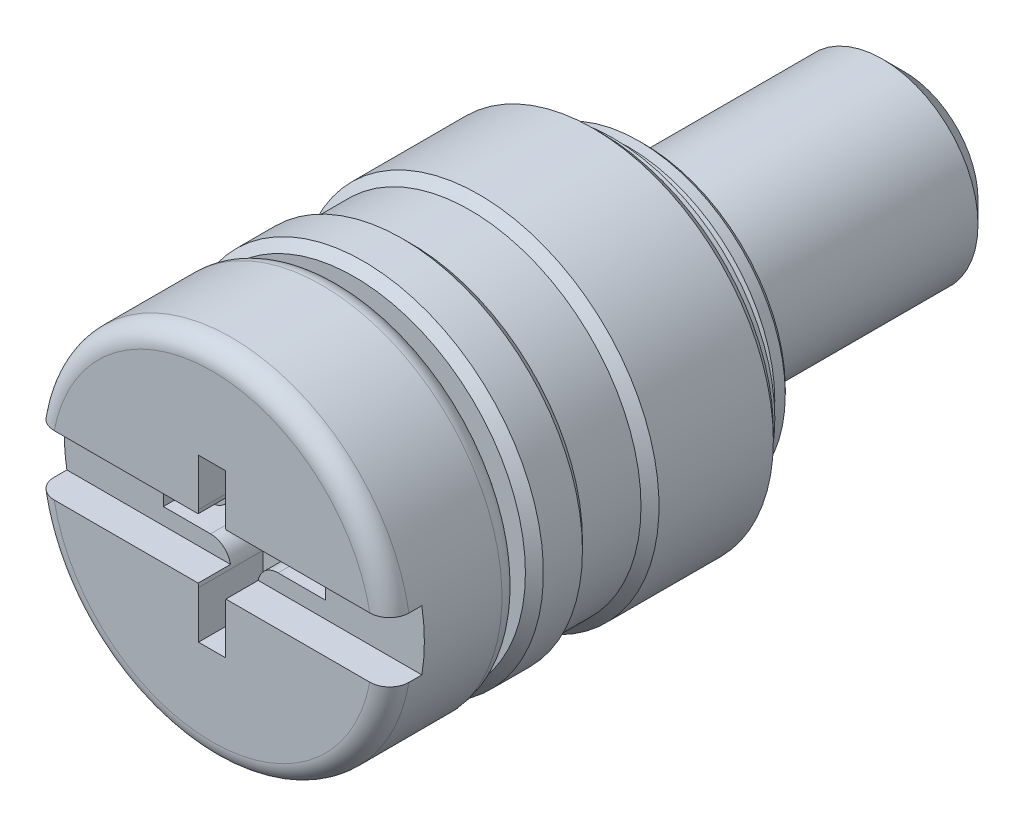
ISO-10303-21;
HEADER;
FILE_DESCRIPTION(('STEP AP214'),'2;1');
FILE_NAME('part.step','',(''),(''),'','','');
FILE_SCHEMA(('AUTOMOTIVE_DESIGN { 1 0 10303 214 1 1 1 1 }'));
ENDSEC;
DATA;
#1=APPLICATION_CONTEXT('core data for automotive mechanical design processes');
#2=APPLICATION_PROTOCOL_DEFINITION('international standard','automotive_design',2000,#1);
#3=PRODUCT_CONTEXT('',#1,'mechanical');
#4=PRODUCT('Part','Part','',(#3));
#5=PRODUCT_RELATED_PRODUCT_CATEGORY('part','',(#4));
#6=PRODUCT_DEFINITION_FORMATION('','',#4);
#7=PRODUCT_DEFINITION_CONTEXT('part definition',#1,'design');
#8=PRODUCT_DEFINITION('design','',#6,#7);
#9=PRODUCT_DEFINITION_SHAPE('','',#8);
#10=(LENGTH_UNIT() NAMED_UNIT(*) SI_UNIT(.MILLI.,.METRE.));
#11=(NAMED_UNIT(*) PLANE_ANGLE_UNIT() SI_UNIT($,.RADIAN.));
#12=(NAMED_UNIT(*) SI_UNIT($,.STERADIAN.) SOLID_ANGLE_UNIT());
#13=UNCERTAINTY_MEASURE_WITH_UNIT(LENGTH_MEASURE(1.E-05),#10,'distance_accuracy_value','');
#14=(GEOMETRIC_REPRESENTATION_CONTEXT(3) GLOBAL_UNCERTAINTY_ASSIGNED_CONTEXT((#13)) GLOBAL_UNIT_ASSIGNED_CONTEXT((#10,
#11,#12)) REPRESENTATION_CONTEXT('',''));
#15=CARTESIAN_POINT('',(0.,0.,0.));
#16=DIRECTION('',(0.,0.,1.));
#17=DIRECTION('',(1.,0.,0.));
#18=AXIS2_PLACEMENT_3D('',#15,#16,#17);
#19=CARTESIAN_POINT('',(-1.765935,-0.2943225,8.509));
#20=DIRECTION('',(0.,-1.,0.));
#21=DIRECTION('',(0.,0.,-1.));
#22=AXIS2_PLACEMENT_3D('',#19,#20,#21);
#23=PLANE('',#22);
#24=DIRECTION('',(0.,0.,-1.));
#25=VECTOR('',#24,1.);
#26=CARTESIAN_POINT('',(-0.73580625,-0.2943225,8.509));
#27=LINE('',#26,#25);
#28=CARTESIAN_POINT('',(-0.73580625,-0.2943225,7.0993));
#29=VERTEX_POINT('',#28);
#30=CARTESIAN_POINT('',(-0.73580625,-0.2943225,7.80415));
#31=VERTEX_POINT('',#30);
#32=EDGE_CURVE('E205',#29,#31,#27,.F.);
#33=ORIENTED_EDGE('',*,*,#32,.F.);
#34=DIRECTION('',(-1.,0.,0.));
#35=VECTOR('',#34,1.);
#36=CARTESIAN_POINT('',(0.,-0.2943225,7.0993));
#37=LINE('',#36,#35);
#38=CARTESIAN_POINT('',(-1.765935,-0.2943225,7.0993));
#39=VERTEX_POINT('',#38);
#40=EDGE_CURVE('E406',#29,#39,#37,.T.);
#41=ORIENTED_EDGE('',*,*,#40,.T.);
#42=DIRECTION('',(0.,0.,1.));
#43=VECTOR('',#42,1.);
#44=CARTESIAN_POINT('',(-1.765935,-0.2943225,8.509));
#45=LINE('',#44,#43);
#46=CARTESIAN_POINT('',(-1.765935,-0.2943225,7.80415));
#47=VERTEX_POINT('',#46);
#48=EDGE_CURVE('E616',#39,#47,#45,.T.);
#49=ORIENTED_EDGE('',*,*,#48,.T.);
#50=DIRECTION('',(1.,0.,0.));
#51=VECTOR('',#50,1.);
#52=CARTESIAN_POINT('',(0.,-0.2943225,7.80415));
#53=LINE('',#52,#51);
#54=EDGE_CURVE('E424',#31,#47,#53,.F.);
#55=ORIENTED_EDGE('',*,*,#54,.F.);
#56=EDGE_LOOP('',(#33,#41,#49,#55));
#57=FACE_BOUND('',#56,.T.);
#58=ADVANCED_FACE('F16',(#57),#23,.F.);
#59=CARTESIAN_POINT('',(-1.765935,0.2943225,8.509));
#60=DIRECTION('',(-1.,0.,0.));
#61=DIRECTION('',(0.,0.,1.));
#62=AXIS2_PLACEMENT_3D('',#59,#60,#61);
#63=PLANE('',#62);
#64=ORIENTED_EDGE('',*,*,#48,.F.);
#65=DIRECTION('',(0.,1.,0.));
#66=VECTOR('',#65,1.);
#67=CARTESIAN_POINT('',(-1.765935,0.,7.0993));
#68=LINE('',#67,#66);
#69=CARTESIAN_POINT('',(-1.765935,0.2943225,7.0993));
#70=VERTEX_POINT('',#69);
#71=EDGE_CURVE('E536',#39,#70,#68,.T.);
#72=ORIENTED_EDGE('',*,*,#71,.T.);
#73=DIRECTION('',(0.,0.,1.));
#74=VECTOR('',#73,1.);
#75=CARTESIAN_POINT('',(-1.765935,0.2943225,8.509));
#76=LINE('',#75,#74);
#77=CARTESIAN_POINT('',(-1.765935,0.2943225,7.80415));
#78=VERTEX_POINT('',#77);
#79=EDGE_CURVE('E608',#70,#78,#76,.T.);
#80=ORIENTED_EDGE('',*,*,#79,.T.);
#81=DIRECTION('',(0.,1.,0.));
#82=VECTOR('',#81,1.);
#83=CARTESIAN_POINT('',(-1.765935,0.,7.80415));
#84=LINE('',#83,#82);
#85=EDGE_CURVE('E560',#47,#78,#84,.T.);
#86=ORIENTED_EDGE('',*,*,#85,.F.);
#87=EDGE_LOOP('',(#64,#72,#80,#86));
#88=FACE_BOUND('',#87,.T.);
#89=ADVANCED_FACE('F1127',(#88),#63,.F.);
#90=CARTESIAN_POINT('',(-0.73580625,0.2943225,8.509));
#91=DIRECTION('',(0.,1.,0.));
#92=DIRECTION('',(0.,0.,1.));
#93=AXIS2_PLACEMENT_3D('',#90,#91,#92);
#94=PLANE('',#93);
#95=ORIENTED_EDGE('',*,*,#79,.F.);
#96=DIRECTION('',(-1.,0.,0.));
#97=VECTOR('',#96,1.);
#98=CARTESIAN_POINT('',(0.,0.2943225,7.0993));
#99=LINE('',#98,#97);
#100=CARTESIAN_POINT('',(-0.73580625,0.2943225,7.0993));
#101=VERTEX_POINT('',#100);
#102=EDGE_CURVE('E403',#70,#101,#99,.F.);
#103=ORIENTED_EDGE('',*,*,#102,.T.);
#104=DIRECTION('',(0.,0.,-1.));
#105=VECTOR('',#104,1.);
#106=CARTESIAN_POINT('',(-0.73580625,0.2943225,8.509));
#107=LINE('',#106,#105);
#108=CARTESIAN_POINT('',(-0.73580625,0.2943225,7.80415));
#109=VERTEX_POINT('',#108);
#110=EDGE_CURVE('E416',#109,#101,#107,.T.);
#111=ORIENTED_EDGE('',*,*,#110,.F.);
#112=DIRECTION('',(1.,0.,0.));
#113=VECTOR('',#112,1.);
#114=CARTESIAN_POINT('',(0.,0.2943225,7.80415));
#115=LINE('',#114,#113);
#116=EDGE_CURVE('E420',#78,#109,#115,.T.);
#117=ORIENTED_EDGE('',*,*,#116,.F.);
#118=EDGE_LOOP('',(#95,#103,#111,#117));
#119=FACE_BOUND('',#118,.T.);
#120=ADVANCED_FACE('F1119',(#119),#94,.F.);
#121=CARTESIAN_POINT('',(1.765935,0.2943225,8.509));
#122=DIRECTION('',(0.,1.,0.));
#123=DIRECTION('',(0.,0.,1.));
#124=AXIS2_PLACEMENT_3D('',#121,#122,#123);
#125=PLANE('',#124);
#126=DIRECTION('',(0.,0.,-1.));
#127=VECTOR('',#126,1.);
#128=CARTESIAN_POINT('',(0.73580625,0.2943225,8.509));
#129=LINE('',#128,#127);
#130=CARTESIAN_POINT('',(0.73580625,0.2943225,7.0993));
#131=VERTEX_POINT('',#130);
#132=CARTESIAN_POINT('',(0.73580625,0.2943225,7.80415));
#133=VERTEX_POINT('',#132);
#134=EDGE_CURVE('E410',#131,#133,#129,.F.);
#135=ORIENTED_EDGE('',*,*,#134,.F.);
#136=DIRECTION('',(-1.,0.,0.));
#137=VECTOR('',#136,1.);
#138=CARTESIAN_POINT('',(0.,0.2943225,7.0993));
#139=LINE('',#138,#137);
#140=CARTESIAN_POINT('',(1.765935,0.2943225,7.0993));
#141=VERTEX_POINT('',#140);
#142=EDGE_CURVE('E399',#131,#141,#139,.F.);
#143=ORIENTED_EDGE('',*,*,#142,.T.);
#144=DIRECTION('',(0.,0.,-1.));
#145=VECTOR('',#144,1.);
#146=CARTESIAN_POINT('',(1.765935,0.2943225,8.509));
#147=LINE('',#146,#145);
#148=CARTESIAN_POINT('',(1.765935,0.2943225,7.80415));
#149=VERTEX_POINT('',#148);
#150=EDGE_CURVE('E601',#141,#149,#147,.F.);
#151=ORIENTED_EDGE('',*,*,#150,.T.);
#152=DIRECTION('',(1.,0.,0.));
#153=VECTOR('',#152,1.);
#154=CARTESIAN_POINT('',(0.,0.2943225,7.80415));
#155=LINE('',#154,#153);
#156=EDGE_CURVE('E434',#133,#149,#155,.T.);
#157=ORIENTED_EDGE('',*,*,#156,.F.);
#158=EDGE_LOOP('',(#135,#143,#151,#157));
#159=FACE_BOUND('',#158,.T.);
#160=ADVANCED_FACE('F1111',(#159),#125,.F.);
#161=CARTESIAN_POINT('',(1.765935,-0.2943225,8.509));
#162=DIRECTION('',(1.,0.,0.));
#163=DIRECTION('',(0.,0.,-1.));
#164=AXIS2_PLACEMENT_3D('',#161,#162,#163);
#165=PLANE('',#164);
#166=ORIENTED_EDGE('',*,*,#150,.F.);
#167=DIRECTION('',(0.,1.,0.));
#168=VECTOR('',#167,1.);
#169=CARTESIAN_POINT('',(1.765935,0.,7.0993));
#170=LINE('',#169,#168);
#171=CARTESIAN_POINT('',(1.765935,-0.2943225,7.0993));
#172=VERTEX_POINT('',#171);
#173=EDGE_CURVE('E529',#141,#172,#170,.F.);
#174=ORIENTED_EDGE('',*,*,#173,.T.);
#175=DIRECTION('',(0.,0.,-1.));
#176=VECTOR('',#175,1.);
#177=CARTESIAN_POINT('',(1.765935,-0.2943225,8.509));
#178=LINE('',#177,#176);
#179=CARTESIAN_POINT('',(1.765935,-0.2943225,7.80415));
#180=VERTEX_POINT('',#179);
#181=EDGE_CURVE('E591',#172,#180,#178,.F.);
#182=ORIENTED_EDGE('',*,*,#181,.T.);
#183=DIRECTION('',(0.,1.,0.));
#184=VECTOR('',#183,1.);
#185=CARTESIAN_POINT('',(1.765935,0.,7.80415));
#186=LINE('',#185,#184);
#187=EDGE_CURVE('E573',#149,#180,#186,.F.);
#188=ORIENTED_EDGE('',*,*,#187,.F.);
#189=EDGE_LOOP('',(#166,#174,#182,#188));
#190=FACE_BOUND('',#189,.T.);
#191=ADVANCED_FACE('F1103',(#190),#165,.F.);
#192=CARTESIAN_POINT('',(0.73580625,-0.2943225,8.509));
#193=DIRECTION('',(0.,-1.,0.));
#194=DIRECTION('',(0.,0.,-1.));
#195=AXIS2_PLACEMENT_3D('',#192,#193,#194);
#196=PLANE('',#195);
#197=ORIENTED_EDGE('',*,*,#181,.F.);
#198=DIRECTION('',(-1.,0.,0.));
#199=VECTOR('',#198,1.);
#200=CARTESIAN_POINT('',(0.,-0.2943225,7.0993));
#201=LINE('',#200,#199);
#202=CARTESIAN_POINT('',(0.73580625,-0.2943225,7.0993));
#203=VERTEX_POINT('',#202);
#204=EDGE_CURVE('E395',#172,#203,#201,.T.);
#205=ORIENTED_EDGE('',*,*,#204,.T.);
#206=DIRECTION('',(0.,0.,-1.));
#207=VECTOR('',#206,1.);
#208=CARTESIAN_POINT('',(0.73580625,-0.2943225,8.509));
#209=LINE('',#208,#207);
#210=CARTESIAN_POINT('',(0.73580625,-0.2943225,7.80415));
#211=VERTEX_POINT('',#210);
#212=EDGE_CURVE('E435',#211,#203,#209,.T.);
#213=ORIENTED_EDGE('',*,*,#212,.F.);
#214=DIRECTION('',(1.,0.,0.));
#215=VECTOR('',#214,1.);
#216=CARTESIAN_POINT('',(0.,-0.2943225,7.80415));
#217=LINE('',#216,#215);
#218=EDGE_CURVE('E432',#180,#211,#217,.F.);
#219=ORIENTED_EDGE('',*,*,#218,.F.);
#220=EDGE_LOOP('',(#197,#205,#213,#219));
#221=FACE_BOUND('',#220,.T.);
#222=ADVANCED_FACE('F1095',(#221),#196,.F.);
#223=CARTESIAN_POINT('',(-0.2943225,-1.765935,8.509));
#224=DIRECTION('',(0.,-1.,0.));
#225=DIRECTION('',(0.,0.,-1.));
#226=AXIS2_PLACEMENT_3D('',#223,#224,#225);
#227=PLANE('',#226);
#228=DIRECTION('',(0.,0.,1.));
#229=VECTOR('',#228,1.);
#230=CARTESIAN_POINT('',(-0.2943225,-1.765935,8.509));
#231=LINE('',#230,#229);
#232=CARTESIAN_POINT('',(-0.2943225,-1.765935,7.0993));
#233=VERTEX_POINT('',#232);
#234=CARTESIAN_POINT('',(-0.2943225,-1.765935,8.509));
#235=VERTEX_POINT('',#234);
#236=EDGE_CURVE('E216',#233,#235,#231,.T.);
#237=ORIENTED_EDGE('',*,*,#236,.T.);
#238=DIRECTION('',(1.,0.,0.));
#239=VECTOR('',#238,1.);
#240=CARTESIAN_POINT('',(-0.2943225,-1.765935,8.509));
#241=LINE('',#240,#239);
#242=CARTESIAN_POINT('',(0.2943225,-1.765935,8.509));
#243=VERTEX_POINT('',#242);
#244=EDGE_CURVE('E206',#243,#235,#241,.F.);
#245=ORIENTED_EDGE('',*,*,#244,.F.);
#246=DIRECTION('',(0.,0.,-1.));
#247=VECTOR('',#246,1.);
#248=CARTESIAN_POINT('',(0.2943225,-1.765935,8.509));
#249=LINE('',#248,#247);
#250=CARTESIAN_POINT('',(0.2943225,-1.765935,7.0993));
#251=VERTEX_POINT('',#250);
#252=EDGE_CURVE('E524',#243,#251,#249,.T.);
#253=ORIENTED_EDGE('',*,*,#252,.T.);
#254=DIRECTION('',(-1.,0.,0.));
#255=VECTOR('',#254,1.);
#256=CARTESIAN_POINT('',(0.,-1.765935,7.0993));
#257=LINE('',#256,#255);
#258=EDGE_CURVE('E407',#251,#233,#257,.T.);
#259=ORIENTED_EDGE('',*,*,#258,.T.);
#260=EDGE_LOOP('',(#237,#245,#253,#259));
#261=FACE_BOUND('',#260,.T.);
#262=ADVANCED_FACE('F1088',(#261),#227,.F.);
#263=CARTESIAN_POINT('',(-0.73580625,-0.73580625,8.509));
#264=DIRECTION('',(0.,0.,-1.));
#265=DIRECTION('',(-1.,0.,0.));
#266=AXIS2_PLACEMENT_3D('',#263,#264,#265);
#267=CYLINDRICAL_SURFACE('',#266,0.44148375);
#268=CARTESIAN_POINT('',(-0.73580625,-0.73580625,7.0993));
#269=DIRECTION('',(0.,0.,-1.));
#270=DIRECTION('',(-1.,0.,0.));
#271=AXIS2_PLACEMENT_3D('',#268,#269,#270);
#272=CIRCLE('',#271,0.44148375);
#273=CARTESIAN_POINT('',(-0.2943225,-0.73580625,7.0993));
#274=VERTEX_POINT('',#273);
#275=EDGE_CURVE('E404',#274,#29,#272,.F.);
#276=ORIENTED_EDGE('',*,*,#275,.T.);
#277=ORIENTED_EDGE('',*,*,#32,.T.);
#278=CARTESIAN_POINT('',(-0.73580625,-0.73580625,7.80415));
#279=DIRECTION('',(0.,0.,-1.));
#280=DIRECTION('',(-1.,0.,0.));
#281=AXIS2_PLACEMENT_3D('',#278,#279,#280);
#282=CIRCLE('',#281,0.44148375);
#283=CARTESIAN_POINT('',(-0.30195856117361,-0.65405,7.80415));
#284=VERTEX_POINT('',#283);
#285=EDGE_CURVE('E421',#284,#31,#282,.F.);
#286=ORIENTED_EDGE('',*,*,#285,.F.);
#287=DIRECTION('',(0.,0.,1.));
#288=VECTOR('',#287,1.);
#289=CARTESIAN_POINT('',(-0.30195856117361,-0.65405,9.21385));
#290=LINE('',#289,#288);
#291=CARTESIAN_POINT('',(-0.30195856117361,-0.65405,8.509));
#292=VERTEX_POINT('',#291);
#293=EDGE_CURVE('E203',#292,#284,#290,.F.);
#294=ORIENTED_EDGE('',*,*,#293,.F.);
#295=CARTESIAN_POINT('',(-0.73580625,-0.73580625,8.509));
#296=DIRECTION('',(0.,0.,-1.));
#297=DIRECTION('',(-1.,0.,0.));
#298=AXIS2_PLACEMENT_3D('',#295,#296,#297);
#299=CIRCLE('',#298,0.44148375);
#300=CARTESIAN_POINT('',(-0.2943225,-0.73580625,8.509));
#301=VERTEX_POINT('',#300);
#302=EDGE_CURVE('E194',#292,#301,#299,.T.);
#303=ORIENTED_EDGE('',*,*,#302,.T.);
#304=DIRECTION('',(0.,0.,1.));
#305=VECTOR('',#304,1.);
#306=CARTESIAN_POINT('',(-0.2943225,-0.73580625,8.509));
#307=LINE('',#306,#305);
#308=EDGE_CURVE('E200',#301,#274,#307,.F.);
#309=ORIENTED_EDGE('',*,*,#308,.T.);
#310=EDGE_LOOP('',(#276,#277,#286,#294,#303,#309));
#311=FACE_BOUND('',#310,.T.);
#312=ADVANCED_FACE('F199',(#311),#267,.T.);
#313=CARTESIAN_POINT('',(0.73580625,-0.73580625,8.509));
#314=DIRECTION('',(0.,0.,-1.));
#315=DIRECTION('',(-1.,0.,0.));
#316=AXIS2_PLACEMENT_3D('',#313,#314,#315);
#317=CYLINDRICAL_SURFACE('',#316,0.44148375);
#318=CARTESIAN_POINT('',(0.73580625,-0.73580625,8.509));
#319=DIRECTION('',(0.,0.,-1.));
#320=DIRECTION('',(-1.,0.,0.));
#321=AXIS2_PLACEMENT_3D('',#318,#319,#320);
#322=CIRCLE('',#321,0.44148375);
#323=CARTESIAN_POINT('',(0.2943225,-0.73580625,8.509));
#324=VERTEX_POINT('',#323);
#325=CARTESIAN_POINT('',(0.30195856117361,-0.65405,8.509));
#326=VERTEX_POINT('',#325);
#327=EDGE_CURVE('E433',#324,#326,#322,.T.);
#328=ORIENTED_EDGE('',*,*,#327,.T.);
#329=DIRECTION('',(0.,0.,1.));
#330=VECTOR('',#329,1.);
#331=CARTESIAN_POINT('',(0.30195856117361,-0.65405,9.21385));
#332=LINE('',#331,#330);
#333=CARTESIAN_POINT('',(0.30195856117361,-0.65405,7.80415));
#334=VERTEX_POINT('',#333);
#335=EDGE_CURVE('E368',#334,#326,#332,.T.);
#336=ORIENTED_EDGE('',*,*,#335,.F.);
#337=CARTESIAN_POINT('',(0.73580625,-0.73580625,7.80415));
#338=DIRECTION('',(0.,0.,-1.));
#339=DIRECTION('',(-1.,0.,0.));
#340=AXIS2_PLACEMENT_3D('',#337,#338,#339);
#341=CIRCLE('',#340,0.44148375);
#342=EDGE_CURVE('E429',#211,#334,#341,.F.);
#343=ORIENTED_EDGE('',*,*,#342,.F.);
#344=ORIENTED_EDGE('',*,*,#212,.T.);
#345=CARTESIAN_POINT('',(0.73580625,-0.73580625,7.0993));
#346=DIRECTION('',(0.,0.,-1.));
#347=DIRECTION('',(-1.,0.,0.));
#348=AXIS2_PLACEMENT_3D('',#345,#346,#347);
#349=CIRCLE('',#348,0.44148375);
#350=CARTESIAN_POINT('',(0.2943225,-0.73580625,7.0993));
#351=VERTEX_POINT('',#350);
#352=EDGE_CURVE('E392',#203,#351,#349,.F.);
#353=ORIENTED_EDGE('',*,*,#352,.T.);
#354=DIRECTION('',(0.,0.,-1.));
#355=VECTOR('',#354,1.);
#356=CARTESIAN_POINT('',(0.2943225,-0.73580625,8.509));
#357=LINE('',#356,#355);
#358=EDGE_CURVE('E394',#351,#324,#357,.F.);
#359=ORIENTED_EDGE('',*,*,#358,.T.);
#360=EDGE_LOOP('',(#328,#336,#343,#344,#353,#359));
#361=FACE_BOUND('',#360,.T.);
#362=ADVANCED_FACE('F1073',(#361),#317,.T.);
#363=CARTESIAN_POINT('',(0.,0.,7.80415));
#364=DIRECTION('',(0.,0.,1.));
#365=DIRECTION('',(1.,0.,0.));
#366=AXIS2_PLACEMENT_3D('',#363,#364,#365);
#367=PLANE('',#366);
#368=CARTESIAN_POINT('',(0.,0.,7.80415));
#369=DIRECTION('',(0.,0.,-1.));
#370=DIRECTION('',(-1.,0.,0.));
#371=AXIS2_PLACEMENT_3D('',#368,#369,#370);
#372=CIRCLE('',#371,3.9243);
#373=CARTESIAN_POINT('',(3.8694119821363,-0.65405,7.80415));
#374=VERTEX_POINT('',#373);
#375=CARTESIAN_POINT('',(3.8694119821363,0.65405,7.80415));
#376=VERTEX_POINT('',#375);
#377=EDGE_CURVE('E427',#374,#376,#372,.F.);
#378=ORIENTED_EDGE('',*,*,#377,.T.);
#379=DIRECTION('',(1.,0.,0.));
#380=VECTOR('',#379,1.);
#381=CARTESIAN_POINT('',(0.,0.65405,7.80415));
#382=LINE('',#381,#380);
#383=CARTESIAN_POINT('',(0.30195856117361,0.65405,7.80415));
#384=VERTEX_POINT('',#383);
#385=EDGE_CURVE('E500',#384,#376,#382,.T.);
#386=ORIENTED_EDGE('',*,*,#385,.F.);
#387=CARTESIAN_POINT('',(0.73580625,0.73580625,7.80415));
#388=DIRECTION('',(0.,0.,-1.));
#389=DIRECTION('',(-1.,0.,0.));
#390=AXIS2_PLACEMENT_3D('',#387,#388,#389);
#391=CIRCLE('',#390,0.44148375);
#392=EDGE_CURVE('E408',#133,#384,#391,.T.);
#393=ORIENTED_EDGE('',*,*,#392,.F.);
#394=ORIENTED_EDGE('',*,*,#156,.T.);
#395=ORIENTED_EDGE('',*,*,#187,.T.);
#396=ORIENTED_EDGE('',*,*,#218,.T.);
#397=ORIENTED_EDGE('',*,*,#342,.T.);
#398=DIRECTION('',(1.,0.,0.));
#399=VECTOR('',#398,1.);
#400=CARTESIAN_POINT('',(0.,-0.65405,7.80415));
#401=LINE('',#400,#399);
#402=EDGE_CURVE('E508',#374,#334,#401,.F.);
#403=ORIENTED_EDGE('',*,*,#402,.F.);
#404=EDGE_LOOP('',(#378,#386,#393,#394,#395,#396,#397,#403));
#405=FACE_BOUND('',#404,.T.);
#406=ADVANCED_FACE('F1065',(#405),#367,.T.);
#407=CARTESIAN_POINT('',(0.,0.,7.80415));
#408=DIRECTION('',(0.,0.,1.));
#409=DIRECTION('',(1.,0.,0.));
#410=AXIS2_PLACEMENT_3D('',#407,#408,#409);
#411=PLANE('',#410);
#412=ORIENTED_EDGE('',*,*,#85,.T.);
#413=ORIENTED_EDGE('',*,*,#116,.T.);
#414=CARTESIAN_POINT('',(-0.73580625,0.73580625,7.80415));
#415=DIRECTION('',(0.,0.,-1.));
#416=DIRECTION('',(-1.,0.,0.));
#417=AXIS2_PLACEMENT_3D('',#414,#415,#416);
#418=CIRCLE('',#417,0.44148375);
#419=CARTESIAN_POINT('',(-0.30195856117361,0.65405,7.80415));
#420=VERTEX_POINT('',#419);
#421=EDGE_CURVE('E417',#420,#109,#418,.T.);
#422=ORIENTED_EDGE('',*,*,#421,.F.);
#423=DIRECTION('',(1.,0.,0.));
#424=VECTOR('',#423,1.);
#425=CARTESIAN_POINT('',(0.,0.65405,7.80415));
#426=LINE('',#425,#424);
#427=CARTESIAN_POINT('',(-3.8694119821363,0.65405,7.80415));
#428=VERTEX_POINT('',#427);
#429=EDGE_CURVE('E567',#428,#420,#426,.T.);
#430=ORIENTED_EDGE('',*,*,#429,.F.);
#431=CARTESIAN_POINT('',(0.,0.,7.80415));
#432=DIRECTION('',(0.,0.,-1.));
#433=DIRECTION('',(-1.,0.,0.));
#434=AXIS2_PLACEMENT_3D('',#431,#432,#433);
#435=CIRCLE('',#434,3.9243);
#436=CARTESIAN_POINT('',(-3.8694119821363,-0.65405,7.80415));
#437=VERTEX_POINT('',#436);
#438=EDGE_CURVE('E425',#428,#437,#435,.F.);
#439=ORIENTED_EDGE('',*,*,#438,.T.);
#440=DIRECTION('',(1.,0.,0.));
#441=VECTOR('',#440,1.);
#442=CARTESIAN_POINT('',(0.,-0.65405,7.80415));
#443=LINE('',#442,#441);
#444=EDGE_CURVE('E516',#284,#437,#443,.F.);
#445=ORIENTED_EDGE('',*,*,#444,.F.);
#446=ORIENTED_EDGE('',*,*,#285,.T.);
#447=ORIENTED_EDGE('',*,*,#54,.T.);
#448=EDGE_LOOP('',(#412,#413,#422,#430,#439,#445,#446,#447));
#449=FACE_BOUND('',#448,.T.);
#450=ADVANCED_FACE('F1057',(#449),#411,.T.);
#451=CARTESIAN_POINT('',(-0.73580625,0.73580625,8.509));
#452=DIRECTION('',(0.,0.,-1.));
#453=DIRECTION('',(-1.,0.,0.));
#454=AXIS2_PLACEMENT_3D('',#451,#452,#453);
#455=CYLINDRICAL_SURFACE('',#454,0.44148375);
#456=DIRECTION('',(0.,0.,1.));
#457=VECTOR('',#456,1.);
#458=CARTESIAN_POINT('',(-0.2943225,0.73580625,8.509));
#459=LINE('',#458,#457);
#460=CARTESIAN_POINT('',(-0.2943225,0.73580625,7.0993));
#461=VERTEX_POINT('',#460);
#462=CARTESIAN_POINT('',(-0.2943225,0.73580625,8.509));
#463=VERTEX_POINT('',#462);
#464=EDGE_CURVE('E569',#461,#463,#459,.T.);
#465=ORIENTED_EDGE('',*,*,#464,.T.);
#466=CARTESIAN_POINT('',(-0.73580625,0.73580625,8.509));
#467=DIRECTION('',(0.,0.,-1.));
#468=DIRECTION('',(-1.,0.,0.));
#469=AXIS2_PLACEMENT_3D('',#466,#467,#468);
#470=CIRCLE('',#469,0.44148375);
#471=CARTESIAN_POINT('',(-0.30195856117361,0.65405,8.509));
#472=VERTEX_POINT('',#471);
#473=EDGE_CURVE('E414',#463,#472,#470,.T.);
#474=ORIENTED_EDGE('',*,*,#473,.T.);
#475=DIRECTION('',(0.,0.,-1.));
#476=VECTOR('',#475,1.);
#477=CARTESIAN_POINT('',(-0.30195856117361,0.65405,9.21385));
#478=LINE('',#477,#476);
#479=EDGE_CURVE('E357',#420,#472,#478,.F.);
#480=ORIENTED_EDGE('',*,*,#479,.F.);
#481=ORIENTED_EDGE('',*,*,#421,.T.);
#482=ORIENTED_EDGE('',*,*,#110,.T.);
#483=CARTESIAN_POINT('',(-0.73580625,0.73580625,7.0993));
#484=DIRECTION('',(0.,0.,-1.));
#485=DIRECTION('',(-1.,0.,0.));
#486=AXIS2_PLACEMENT_3D('',#483,#484,#485);
#487=CIRCLE('',#486,0.44148375);
#488=EDGE_CURVE('E401',#101,#461,#487,.F.);
#489=ORIENTED_EDGE('',*,*,#488,.T.);
#490=EDGE_LOOP('',(#465,#474,#480,#481,#482,#489));
#491=FACE_BOUND('',#490,.T.);
#492=ADVANCED_FACE('F1049',(#491),#455,.T.);
#493=CARTESIAN_POINT('',(0.2943225,1.765935,8.509));
#494=DIRECTION('',(0.,1.,0.));
#495=DIRECTION('',(0.,0.,1.));
#496=AXIS2_PLACEMENT_3D('',#493,#494,#495);
#497=PLANE('',#496);
#498=DIRECTION('',(0.,0.,-1.));
#499=VECTOR('',#498,1.);
#500=CARTESIAN_POINT('',(0.2943225,1.765935,8.509));
#501=LINE('',#500,#499);
#502=CARTESIAN_POINT('',(0.2943225,1.765935,7.0993));
#503=VERTEX_POINT('',#502);
#504=CARTESIAN_POINT('',(0.2943225,1.765935,8.509));
#505=VERTEX_POINT('',#504);
#506=EDGE_CURVE('E555',#503,#505,#501,.F.);
#507=ORIENTED_EDGE('',*,*,#506,.T.);
#508=DIRECTION('',(1.,0.,0.));
#509=VECTOR('',#508,1.);
#510=CARTESIAN_POINT('',(0.2943225,1.765935,8.509));
#511=LINE('',#510,#509);
#512=CARTESIAN_POINT('',(-0.2943225,1.765935,8.509));
#513=VERTEX_POINT('',#512);
#514=EDGE_CURVE('E413',#513,#505,#511,.T.);
#515=ORIENTED_EDGE('',*,*,#514,.F.);
#516=DIRECTION('',(0.,0.,1.));
#517=VECTOR('',#516,1.);
#518=CARTESIAN_POINT('',(-0.2943225,1.765935,8.509));
#519=LINE('',#518,#517);
#520=CARTESIAN_POINT('',(-0.2943225,1.765935,7.0993));
#521=VERTEX_POINT('',#520);
#522=EDGE_CURVE('E556',#513,#521,#519,.F.);
#523=ORIENTED_EDGE('',*,*,#522,.T.);
#524=DIRECTION('',(-1.,0.,0.));
#525=VECTOR('',#524,1.);
#526=CARTESIAN_POINT('',(0.,1.765935,7.0993));
#527=LINE('',#526,#525);
#528=EDGE_CURVE('E400',#521,#503,#527,.F.);
#529=ORIENTED_EDGE('',*,*,#528,.T.);
#530=EDGE_LOOP('',(#507,#515,#523,#529));
#531=FACE_BOUND('',#530,.T.);
#532=ADVANCED_FACE('F1041',(#531),#497,.F.);
#533=CARTESIAN_POINT('',(0.73580625,0.73580625,8.509));
#534=DIRECTION('',(0.,0.,-1.));
#535=DIRECTION('',(-1.,0.,0.));
#536=AXIS2_PLACEMENT_3D('',#533,#534,#535);
#537=CYLINDRICAL_SURFACE('',#536,0.44148375);
#538=ORIENTED_EDGE('',*,*,#134,.T.);
#539=ORIENTED_EDGE('',*,*,#392,.T.);
#540=DIRECTION('',(0.,0.,-1.));
#541=VECTOR('',#540,1.);
#542=CARTESIAN_POINT('',(0.30195856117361,0.65405,9.21385));
#543=LINE('',#542,#541);
#544=CARTESIAN_POINT('',(0.30195856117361,0.65405,8.509));
#545=VERTEX_POINT('',#544);
#546=EDGE_CURVE('E502',#545,#384,#543,.T.);
#547=ORIENTED_EDGE('',*,*,#546,.F.);
#548=CARTESIAN_POINT('',(0.73580625,0.73580625,8.509));
#549=DIRECTION('',(0.,0.,-1.));
#550=DIRECTION('',(-1.,0.,0.));
#551=AXIS2_PLACEMENT_3D('',#548,#549,#550);
#552=CIRCLE('',#551,0.44148375);
#553=CARTESIAN_POINT('',(0.2943225,0.73580625,8.509));
#554=VERTEX_POINT('',#553);
#555=EDGE_CURVE('E411',#545,#554,#552,.T.);
#556=ORIENTED_EDGE('',*,*,#555,.T.);
#557=DIRECTION('',(0.,0.,-1.));
#558=VECTOR('',#557,1.);
#559=CARTESIAN_POINT('',(0.2943225,0.73580625,8.509));
#560=LINE('',#559,#558);
#561=CARTESIAN_POINT('',(0.2943225,0.73580625,7.0993));
#562=VERTEX_POINT('',#561);
#563=EDGE_CURVE('E244',#554,#562,#560,.T.);
#564=ORIENTED_EDGE('',*,*,#563,.T.);
#565=CARTESIAN_POINT('',(0.73580625,0.73580625,7.0993));
#566=DIRECTION('',(0.,0.,-1.));
#567=DIRECTION('',(-1.,0.,0.));
#568=AXIS2_PLACEMENT_3D('',#565,#566,#567);
#569=CIRCLE('',#568,0.44148375);
#570=EDGE_CURVE('E396',#562,#131,#569,.F.);
#571=ORIENTED_EDGE('',*,*,#570,.T.);
#572=EDGE_LOOP('',(#538,#539,#547,#556,#564,#571));
#573=FACE_BOUND('',#572,.T.);
#574=ADVANCED_FACE('F1033',(#573),#537,.T.);
#575=CARTESIAN_POINT('',(0.,0.,7.0993));
#576=DIRECTION('',(0.,0.,-1.));
#577=DIRECTION('',(-1.,0.,0.));
#578=AXIS2_PLACEMENT_3D('',#575,#576,#577);
#579=PLANE('',#578);
#580=ORIENTED_EDGE('',*,*,#352,.F.);
#581=ORIENTED_EDGE('',*,*,#204,.F.);
#582=ORIENTED_EDGE('',*,*,#173,.F.);
#583=ORIENTED_EDGE('',*,*,#142,.F.);
#584=ORIENTED_EDGE('',*,*,#570,.F.);
#585=DIRECTION('',(0.,1.,0.));
#586=VECTOR('',#585,1.);
#587=CARTESIAN_POINT('',(0.2943225,0.73580625,7.0993));
#588=LINE('',#587,#586);
#589=EDGE_CURVE('E227',#562,#503,#588,.T.);
#590=ORIENTED_EDGE('',*,*,#589,.T.);
#591=ORIENTED_EDGE('',*,*,#528,.F.);
#592=DIRECTION('',(0.,1.,0.));
#593=VECTOR('',#592,1.);
#594=CARTESIAN_POINT('',(-0.2943225,1.765935,7.0993));
#595=LINE('',#594,#593);
#596=EDGE_CURVE('E552',#521,#461,#595,.F.);
#597=ORIENTED_EDGE('',*,*,#596,.T.);
#598=ORIENTED_EDGE('',*,*,#488,.F.);
#599=ORIENTED_EDGE('',*,*,#102,.F.);
#600=ORIENTED_EDGE('',*,*,#71,.F.);
#601=ORIENTED_EDGE('',*,*,#40,.F.);
#602=ORIENTED_EDGE('',*,*,#275,.F.);
#603=DIRECTION('',(0.,1.,0.));
#604=VECTOR('',#603,1.);
#605=CARTESIAN_POINT('',(-0.2943225,-0.73580625,7.0993));
#606=LINE('',#605,#604);
#607=EDGE_CURVE('E215',#274,#233,#606,.F.);
#608=ORIENTED_EDGE('',*,*,#607,.T.);
#609=ORIENTED_EDGE('',*,*,#258,.F.);
#610=DIRECTION('',(0.,1.,0.));
#611=VECTOR('',#610,1.);
#612=CARTESIAN_POINT('',(0.2943225,-1.765935,7.0993));
#613=LINE('',#612,#611);
#614=EDGE_CURVE('E519',#251,#351,#613,.T.);
#615=ORIENTED_EDGE('',*,*,#614,.T.);
#616=EDGE_LOOP('',(#580,#581,#582,#583,#584,#590,#591,#597,#598,#599,#600,#601,#602,#608,#609,#615));
#617=FACE_BOUND('',#616,.T.);
#618=ADVANCED_FACE('F1026',(#617),#579,.F.);
#619=CARTESIAN_POINT('',(0.2943225,-1.765935,8.509));
#620=DIRECTION('',(1.,0.,0.));
#621=DIRECTION('',(0.,0.,-1.));
#622=AXIS2_PLACEMENT_3D('',#619,#620,#621);
#623=PLANE('',#622);
#624=ORIENTED_EDGE('',*,*,#252,.F.);
#625=DIRECTION('',(0.,1.,0.));
#626=VECTOR('',#625,1.);
#627=CARTESIAN_POINT('',(0.2943225,0.,8.509));
#628=LINE('',#627,#626);
#629=EDGE_CURVE('E223',#324,#243,#628,.F.);
#630=ORIENTED_EDGE('',*,*,#629,.F.);
#631=ORIENTED_EDGE('',*,*,#358,.F.);
#632=ORIENTED_EDGE('',*,*,#614,.F.);
#633=EDGE_LOOP('',(#624,#630,#631,#632));
#634=FACE_BOUND('',#633,.T.);
#635=ADVANCED_FACE('F1020',(#634),#623,.F.);
#636=CARTESIAN_POINT('',(-0.2943225,-0.73580625,8.509));
#637=DIRECTION('',(-1.,0.,0.));
#638=DIRECTION('',(0.,0.,1.));
#639=AXIS2_PLACEMENT_3D('',#636,#637,#638);
#640=PLANE('',#639);
#641=ORIENTED_EDGE('',*,*,#308,.F.);
#642=DIRECTION('',(0.,1.,0.));
#643=VECTOR('',#642,1.);
#644=CARTESIAN_POINT('',(-0.2943225,0.,8.509));
#645=LINE('',#644,#643);
#646=EDGE_CURVE('E213',#235,#301,#645,.T.);
#647=ORIENTED_EDGE('',*,*,#646,.F.);
#648=ORIENTED_EDGE('',*,*,#236,.F.);
#649=ORIENTED_EDGE('',*,*,#607,.F.);
#650=EDGE_LOOP('',(#641,#647,#648,#649));
#651=FACE_BOUND('',#650,.T.);
#652=ADVANCED_FACE('F211',(#651),#640,.F.);
#653=CARTESIAN_POINT('',(0.,-0.65405,9.21385));
#654=DIRECTION('',(0.,1.,0.));
#655=DIRECTION('',(0.,0.,1.));
#656=AXIS2_PLACEMENT_3D('',#653,#654,#655);
#657=PLANE('',#656);
#658=CARTESIAN_POINT('',(-3.8694119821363,-0.654049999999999,8.08609));
#659=CARTESIAN_POINT('',(-3.86943343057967,-0.654049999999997,8.10963341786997));
#660=CARTESIAN_POINT('',(-3.86741944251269,-0.654049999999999,8.13316902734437));
#661=CARTESIAN_POINT('',(-3.85948094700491,-0.654050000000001,8.1795444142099));
#662=CARTESIAN_POINT('',(-3.853560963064,-0.654050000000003,8.20238496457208));
#663=CARTESIAN_POINT('',(-3.83796737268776,-0.654050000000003,8.24675538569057));
#664=CARTESIAN_POINT('',(-3.82829242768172,-0.654050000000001,8.26828478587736));
#665=CARTESIAN_POINT('',(-3.80548766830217,-0.654049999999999,8.30942442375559));
#666=CARTESIAN_POINT('',(-3.79235810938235,-0.654049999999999,8.32903480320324));
#667=CARTESIAN_POINT('',(-3.76294454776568,-0.654049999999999,8.365911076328));
#668=CARTESIAN_POINT('',(-3.74664287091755,-0.65405,8.38316286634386));
#669=CARTESIAN_POINT('',(-3.71140752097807,-0.65405,8.41472955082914));
#670=CARTESIAN_POINT('',(-3.69247357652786,-0.65405,8.42904414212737));
#671=CARTESIAN_POINT('',(-3.65224100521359,-0.65405,8.45453889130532));
#672=CARTESIAN_POINT('',(-3.63091371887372,-0.65405,8.46567376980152));
#673=CARTESIAN_POINT('',(-3.58671400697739,-0.65405,8.48426141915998));
#674=CARTESIAN_POINT('',(-3.56384209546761,-0.654049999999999,8.49171540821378));
#675=CARTESIAN_POINT('',(-3.52402028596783,-0.65405,8.50114958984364));
#676=CARTESIAN_POINT('',(-3.50729155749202,-0.654050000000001,8.50409261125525));
#677=CARTESIAN_POINT('',(-3.47363048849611,-0.654049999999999,8.50801770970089));
#678=CARTESIAN_POINT('',(-3.45669848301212,-0.654049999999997,8.50900265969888));
#679=CARTESIAN_POINT('',(-3.43976024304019,-0.654049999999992,8.509));
#680=B_SPLINE_CURVE_WITH_KNOTS('',3,(#658,#659,#660,#661,#662,#663,#664,#665,#666,#667,#668,
#669,#670,#671,#672,#673,#674,#675,#676,#677,#678,#679),.UNSPECIFIED.,.F.,.F.,(4,2,2,2,2,2,2,2,
2,2,4),(0.,0.0705327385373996,0.140983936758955,0.211460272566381,0.281931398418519,
0.352807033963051,0.423689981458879,0.495537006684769,0.567360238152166,0.618208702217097,
0.668982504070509),.UNSPECIFIED.);
#681=CARTESIAN_POINT('',(-3.8694119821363,-0.654049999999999,8.08609));
#682=VERTEX_POINT('',#681);
#683=CARTESIAN_POINT('',(-3.4397602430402,-0.65405,8.509));
#684=VERTEX_POINT('',#683);
#685=EDGE_CURVE('E374',#682,#684,#680,.T.);
#686=ORIENTED_EDGE('',*,*,#685,.T.);
#687=DIRECTION('',(1.,0.,0.));
#688=VECTOR('',#687,1.);
#689=CARTESIAN_POINT('',(1.750695,-0.65405,8.509));
#690=LINE('',#689,#688);
#691=EDGE_CURVE('E222',#292,#684,#690,.F.);
#692=ORIENTED_EDGE('',*,*,#691,.F.);
#693=ORIENTED_EDGE('',*,*,#293,.T.);
#694=ORIENTED_EDGE('',*,*,#444,.T.);
#695=DIRECTION('',(0.,0.,1.));
#696=VECTOR('',#695,1.);
#697=CARTESIAN_POINT('',(-3.8694119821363,-0.65405,9.21385));
#698=LINE('',#697,#696);
#699=EDGE_CURVE('E513',#437,#682,#698,.T.);
#700=ORIENTED_EDGE('',*,*,#699,.T.);
#701=EDGE_LOOP('',(#686,#692,#693,#694,#700));
#702=FACE_BOUND('',#701,.T.);
#703=ADVANCED_FACE('F380',(#702),#657,.T.);
#704=CARTESIAN_POINT('',(0.,-0.65405,9.21385));
#705=DIRECTION('',(0.,1.,0.));
#706=DIRECTION('',(0.,0.,1.));
#707=AXIS2_PLACEMENT_3D('',#704,#705,#706);
#708=PLANE('',#707);
#709=DIRECTION('',(0.,0.,1.));
#710=VECTOR('',#709,1.);
#711=CARTESIAN_POINT('',(3.8694119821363,-0.65405,9.21385));
#712=LINE('',#711,#710);
#713=CARTESIAN_POINT('',(3.8694119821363,-0.65405,8.08609));
#714=VERTEX_POINT('',#713);
#715=EDGE_CURVE('E367',#714,#374,#712,.F.);
#716=ORIENTED_EDGE('',*,*,#715,.T.);
#717=ORIENTED_EDGE('',*,*,#402,.T.);
#718=ORIENTED_EDGE('',*,*,#335,.T.);
#719=DIRECTION('',(1.,0.,0.));
#720=VECTOR('',#719,1.);
#721=CARTESIAN_POINT('',(1.750695,-0.65405,8.509));
#722=LINE('',#721,#720);
#723=CARTESIAN_POINT('',(3.4397602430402,-0.654049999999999,8.509));
#724=VERTEX_POINT('',#723);
#725=EDGE_CURVE('E225',#724,#326,#722,.F.);
#726=ORIENTED_EDGE('',*,*,#725,.F.);
#727=CARTESIAN_POINT('',(3.4397602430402,-0.654049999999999,8.509));
#728=CARTESIAN_POINT('',(3.46423354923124,-0.654050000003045,8.50901922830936));
#729=CARTESIAN_POINT('',(3.48870460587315,-0.654050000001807,8.50695081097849));
#730=CARTESIAN_POINT('',(3.53695527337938,-0.654049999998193,8.49876682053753));
#731=CARTESIAN_POINT('',(3.56073503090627,-0.654049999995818,8.4926521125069));
#732=CARTESIAN_POINT('',(3.60694414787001,-0.654049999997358,8.47649764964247));
#733=CARTESIAN_POINT('',(3.62937250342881,-0.654050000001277,8.46645501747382));
#734=CARTESIAN_POINT('',(3.67219540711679,-0.654049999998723,8.44271560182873));
#735=CARTESIAN_POINT('',(3.69259067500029,-0.654049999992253,8.42902011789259));
#736=CARTESIAN_POINT('',(3.73056335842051,-0.65404999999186,8.39848817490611));
#737=CARTESIAN_POINT('',(3.74816532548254,-0.654049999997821,8.38168226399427));
#738=CARTESIAN_POINT('',(3.78024319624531,-0.654050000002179,8.34531400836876));
#739=CARTESIAN_POINT('',(3.79471956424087,-0.654050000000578,8.32575207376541));
#740=CARTESIAN_POINT('',(3.81990932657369,-0.654049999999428,8.28474160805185));
#741=CARTESIAN_POINT('',(3.83067530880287,-0.654049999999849,8.26332533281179));
#742=CARTESIAN_POINT('',(3.84840078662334,-0.654050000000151,8.21897973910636));
#743=CARTESIAN_POINT('',(3.85536331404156,-0.654050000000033,8.19605164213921));
#744=CARTESIAN_POINT('',(3.86334089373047,-0.65404999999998,8.15847481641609));
#745=CARTESIAN_POINT('',(3.86561631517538,-0.654049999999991,8.14408180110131));
#746=CARTESIAN_POINT('',(3.86865143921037,-0.654050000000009,8.11515806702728));
#747=CARTESIAN_POINT('',(3.86941334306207,-0.654050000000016,8.10062757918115));
#748=CARTESIAN_POINT('',(3.86941198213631,-0.654049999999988,8.08609000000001));
#749=B_SPLINE_CURVE_WITH_KNOTS('',3,(#727,#728,#729,#730,#731,#732,#733,#734,#735,#736,#737,
#738,#739,#740,#741,#742,#743,#744,#745,#746,#747,#748),.UNSPECIFIED.,.F.,.F.,(4,2,2,2,2,2,2,2,
2,2,4),(0.,0.0733299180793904,0.146644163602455,0.220012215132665,0.293354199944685,
0.366010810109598,0.438656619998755,0.510225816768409,0.581737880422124,0.625380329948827,
0.668959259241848),.UNSPECIFIED.);
#750=EDGE_CURVE('E364',#724,#714,#749,.T.);
#751=ORIENTED_EDGE('',*,*,#750,.T.);
#752=EDGE_LOOP('',(#716,#717,#718,#726,#751));
#753=FACE_BOUND('',#752,.T.);
#754=ADVANCED_FACE('F376',(#753),#708,.T.);
#755=CARTESIAN_POINT('',(0.,0.65405,9.21385));
#756=DIRECTION('',(0.,-1.,0.));
#757=DIRECTION('',(0.,0.,-1.));
#758=AXIS2_PLACEMENT_3D('',#755,#756,#757);
#759=PLANE('',#758);
#760=CARTESIAN_POINT('',(3.8694119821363,0.65405,8.08609));
#761=CARTESIAN_POINT('',(3.86943343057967,0.654050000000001,8.10963341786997));
#762=CARTESIAN_POINT('',(3.86741944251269,0.654050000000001,8.13316902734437));
#763=CARTESIAN_POINT('',(3.85948094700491,0.654049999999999,8.1795444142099));
#764=CARTESIAN_POINT('',(3.853560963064,0.654049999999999,8.20238496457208));
#765=CARTESIAN_POINT('',(3.83796737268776,0.654049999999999,8.24675538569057));
#766=CARTESIAN_POINT('',(3.82829242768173,0.654049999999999,8.26828478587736));
#767=CARTESIAN_POINT('',(3.80548766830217,0.654050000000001,8.30942442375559));
#768=CARTESIAN_POINT('',(3.79235810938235,0.654050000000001,8.32903480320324));
#769=CARTESIAN_POINT('',(3.76294454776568,0.654050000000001,8.365911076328));
#770=CARTESIAN_POINT('',(3.74664287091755,0.654050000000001,8.38316286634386));
#771=CARTESIAN_POINT('',(3.71140752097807,0.654049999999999,8.41472955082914));
#772=CARTESIAN_POINT('',(3.69247357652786,0.654049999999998,8.42904414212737));
#773=CARTESIAN_POINT('',(3.65224100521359,0.654049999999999,8.45453889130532));
#774=CARTESIAN_POINT('',(3.63091371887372,0.65405,8.46567376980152));
#775=CARTESIAN_POINT('',(3.58671400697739,0.65405,8.48426141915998));
#776=CARTESIAN_POINT('',(3.56384209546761,0.654049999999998,8.49171540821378));
#777=CARTESIAN_POINT('',(3.52402028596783,0.654049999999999,8.50114958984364));
#778=CARTESIAN_POINT('',(3.50729155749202,0.65405,8.50409261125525));
#779=CARTESIAN_POINT('',(3.47363048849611,0.65405,8.50801770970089));
#780=CARTESIAN_POINT('',(3.45669848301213,0.654049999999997,8.50900265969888));
#781=CARTESIAN_POINT('',(3.43976024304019,0.654049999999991,8.509));
#782=B_SPLINE_CURVE_WITH_KNOTS('',3,(#760,#761,#762,#763,#764,#765,#766,#767,#768,#769,#770,
#771,#772,#773,#774,#775,#776,#777,#778,#779,#780,#781),.UNSPECIFIED.,.F.,.F.,(4,2,2,2,2,2,2,2,
2,2,4),(0.,0.0705327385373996,0.140983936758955,0.21146027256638,0.281931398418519,
0.352807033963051,0.42368998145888,0.495537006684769,0.567360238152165,0.618208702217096,
0.668982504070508),.UNSPECIFIED.);
#783=CARTESIAN_POINT('',(3.8694119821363,0.65405,8.08609));
#784=VERTEX_POINT('',#783);
#785=CARTESIAN_POINT('',(3.4397602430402,0.65405,8.509));
#786=VERTEX_POINT('',#785);
#787=EDGE_CURVE('E355',#784,#786,#782,.T.);
#788=ORIENTED_EDGE('',*,*,#787,.T.);
#789=DIRECTION('',(1.,0.,0.));
#790=VECTOR('',#789,1.);
#791=CARTESIAN_POINT('',(1.750695,0.65405,8.509));
#792=LINE('',#791,#790);
#793=EDGE_CURVE('E300',#545,#786,#792,.T.);
#794=ORIENTED_EDGE('',*,*,#793,.F.);
#795=ORIENTED_EDGE('',*,*,#546,.T.);
#796=ORIENTED_EDGE('',*,*,#385,.T.);
#797=DIRECTION('',(0.,0.,-1.));
#798=VECTOR('',#797,1.);
#799=CARTESIAN_POINT('',(3.8694119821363,0.65405,9.21385));
#800=LINE('',#799,#798);
#801=EDGE_CURVE('E358',#376,#784,#800,.F.);
#802=ORIENTED_EDGE('',*,*,#801,.T.);
#803=EDGE_LOOP('',(#788,#794,#795,#796,#802));
#804=FACE_BOUND('',#803,.T.);
#805=ADVANCED_FACE('F342',(#804),#759,.T.);
#806=CARTESIAN_POINT('',(0.,0.65405,9.21385));
#807=DIRECTION('',(0.,-1.,0.));
#808=DIRECTION('',(0.,0.,-1.));
#809=AXIS2_PLACEMENT_3D('',#806,#807,#808);
#810=PLANE('',#809);
#811=DIRECTION('',(0.,0.,-1.));
#812=VECTOR('',#811,1.);
#813=CARTESIAN_POINT('',(-3.8694119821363,0.65405,9.21385));
#814=LINE('',#813,#812);
#815=CARTESIAN_POINT('',(-3.8694119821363,0.65405,8.08609));
#816=VERTEX_POINT('',#815);
#817=EDGE_CURVE('E494',#816,#428,#814,.T.);
#818=ORIENTED_EDGE('',*,*,#817,.T.);
#819=ORIENTED_EDGE('',*,*,#429,.T.);
#820=ORIENTED_EDGE('',*,*,#479,.T.);
#821=DIRECTION('',(1.,0.,0.));
#822=VECTOR('',#821,1.);
#823=CARTESIAN_POINT('',(1.750695,0.65405,8.509));
#824=LINE('',#823,#822);
#825=CARTESIAN_POINT('',(-3.4397602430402,0.65405,8.509));
#826=VERTEX_POINT('',#825);
#827=EDGE_CURVE('E296',#826,#472,#824,.T.);
#828=ORIENTED_EDGE('',*,*,#827,.F.);
#829=CARTESIAN_POINT('',(-3.4397602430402,0.65405,8.509));
#830=CARTESIAN_POINT('',(-3.46423354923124,0.654050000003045,8.50901922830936));
#831=CARTESIAN_POINT('',(-3.48870460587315,0.654050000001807,8.50695081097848));
#832=CARTESIAN_POINT('',(-3.53695527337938,0.654049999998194,8.49876682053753));
#833=CARTESIAN_POINT('',(-3.56073503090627,0.654049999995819,8.4926521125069));
#834=CARTESIAN_POINT('',(-3.60694414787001,0.654049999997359,8.47649764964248));
#835=CARTESIAN_POINT('',(-3.62937250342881,0.654050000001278,8.46645501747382));
#836=CARTESIAN_POINT('',(-3.67219540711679,0.654049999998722,8.44271560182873));
#837=CARTESIAN_POINT('',(-3.69259067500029,0.654049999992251,8.42902011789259));
#838=CARTESIAN_POINT('',(-3.73056335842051,0.654049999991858,8.39848817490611));
#839=CARTESIAN_POINT('',(-3.74816532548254,0.65404999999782,8.38168226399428));
#840=CARTESIAN_POINT('',(-3.78024319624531,0.65405000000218,8.34531400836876));
#841=CARTESIAN_POINT('',(-3.79471956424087,0.654050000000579,8.32575207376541));
#842=CARTESIAN_POINT('',(-3.81990932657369,0.654049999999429,8.28474160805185));
#843=CARTESIAN_POINT('',(-3.83067530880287,0.654049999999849,8.26332533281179));
#844=CARTESIAN_POINT('',(-3.84840078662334,0.654050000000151,8.21897973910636));
#845=CARTESIAN_POINT('',(-3.85536331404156,0.654050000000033,8.19605164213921));
#846=CARTESIAN_POINT('',(-3.86334089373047,0.65404999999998,8.15847481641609));
#847=CARTESIAN_POINT('',(-3.86561631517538,0.654049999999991,8.14408180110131));
#848=CARTESIAN_POINT('',(-3.86865143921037,0.654050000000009,8.11515806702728));
#849=CARTESIAN_POINT('',(-3.86941334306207,0.654050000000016,8.10062757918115));
#850=CARTESIAN_POINT('',(-3.86941198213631,0.654049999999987,8.08609000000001));
#851=B_SPLINE_CURVE_WITH_KNOTS('',3,(#829,#830,#831,#832,#833,#834,#835,#836,#837,#838,#839,
#840,#841,#842,#843,#844,#845,#846,#847,#848,#849,#850),.UNSPECIFIED.,.F.,.F.,(4,2,2,2,2,2,2,2,
2,2,4),(0.,0.0733299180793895,0.146644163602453,0.220012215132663,0.293354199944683,
0.366010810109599,0.438656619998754,0.510225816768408,0.581737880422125,0.625380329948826,
0.668959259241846),.UNSPECIFIED.);
#852=EDGE_CURVE('E353',#826,#816,#851,.T.);
#853=ORIENTED_EDGE('',*,*,#852,.T.);
#854=EDGE_LOOP('',(#818,#819,#820,#828,#853));
#855=FACE_BOUND('',#854,.T.);
#856=ADVANCED_FACE('F337',(#855),#810,.T.);
#857=CARTESIAN_POINT('',(-0.2943225,1.765935,8.509));
#858=DIRECTION('',(-1.,0.,0.));
#859=DIRECTION('',(0.,0.,1.));
#860=AXIS2_PLACEMENT_3D('',#857,#858,#859);
#861=PLANE('',#860);
#862=ORIENTED_EDGE('',*,*,#522,.F.);
#863=DIRECTION('',(0.,1.,0.));
#864=VECTOR('',#863,1.);
#865=CARTESIAN_POINT('',(-0.2943225,0.,8.509));
#866=LINE('',#865,#864);
#867=EDGE_CURVE('E291',#463,#513,#866,.T.);
#868=ORIENTED_EDGE('',*,*,#867,.F.);
#869=ORIENTED_EDGE('',*,*,#464,.F.);
#870=ORIENTED_EDGE('',*,*,#596,.F.);
#871=EDGE_LOOP('',(#862,#868,#869,#870));
#872=FACE_BOUND('',#871,.T.);
#873=ADVANCED_FACE('F333',(#872),#861,.F.);
#874=CARTESIAN_POINT('',(0.2943225,0.73580625,8.509));
#875=DIRECTION('',(1.,0.,0.));
#876=DIRECTION('',(0.,0.,-1.));
#877=AXIS2_PLACEMENT_3D('',#874,#875,#876);
#878=PLANE('',#877);
#879=ORIENTED_EDGE('',*,*,#563,.F.);
#880=DIRECTION('',(0.,1.,0.));
#881=VECTOR('',#880,1.);
#882=CARTESIAN_POINT('',(0.2943225,0.,8.509));
#883=LINE('',#882,#881);
#884=EDGE_CURVE('E283',#505,#554,#883,.F.);
#885=ORIENTED_EDGE('',*,*,#884,.F.);
#886=ORIENTED_EDGE('',*,*,#506,.F.);
#887=ORIENTED_EDGE('',*,*,#589,.F.);
#888=EDGE_LOOP('',(#879,#885,#886,#887));
#889=FACE_BOUND('',#888,.T.);
#890=ADVANCED_FACE('F330',(#889),#878,.F.);
#891=CARTESIAN_POINT('',(1.750695,0.,8.509));
#892=DIRECTION('',(0.,0.,1.));
#893=DIRECTION('',(1.,0.,0.));
#894=AXIS2_PLACEMENT_3D('',#891,#892,#893);
#895=PLANE('',#894);
#896=CARTESIAN_POINT('',(0.,0.,8.509));
#897=DIRECTION('',(0.,0.,-1.));
#898=DIRECTION('',(0.982398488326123,-0.186797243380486,0.));
#899=AXIS2_PLACEMENT_3D('',#896,#897,#898);
#900=CIRCLE('',#899,3.50139);
#901=EDGE_CURVE('E239',#724,#684,#900,.T.);
#902=ORIENTED_EDGE('',*,*,#901,.F.);
#903=ORIENTED_EDGE('',*,*,#725,.T.);
#904=ORIENTED_EDGE('',*,*,#327,.F.);
#905=ORIENTED_EDGE('',*,*,#629,.T.);
#906=ORIENTED_EDGE('',*,*,#244,.T.);
#907=ORIENTED_EDGE('',*,*,#646,.T.);
#908=ORIENTED_EDGE('',*,*,#302,.F.);
#909=ORIENTED_EDGE('',*,*,#691,.T.);
#910=EDGE_LOOP('',(#902,#903,#904,#905,#906,#907,#908,#909));
#911=FACE_BOUND('',#910,.T.);
#912=ADVANCED_FACE('F219',(#911),#895,.T.);
#913=CARTESIAN_POINT('',(1.750695,0.,8.509));
#914=DIRECTION('',(0.,0.,1.));
#915=DIRECTION('',(1.,0.,0.));
#916=AXIS2_PLACEMENT_3D('',#913,#914,#915);
#917=PLANE('',#916);
#918=ORIENTED_EDGE('',*,*,#514,.T.);
#919=ORIENTED_EDGE('',*,*,#884,.T.);
#920=ORIENTED_EDGE('',*,*,#555,.F.);
#921=ORIENTED_EDGE('',*,*,#793,.T.);
#922=CARTESIAN_POINT('',(0.,0.,8.509));
#923=DIRECTION('',(0.,0.,-1.));
#924=DIRECTION('',(-0.982398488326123,0.186797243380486,0.));
#925=AXIS2_PLACEMENT_3D('',#922,#923,#924);
#926=CIRCLE('',#925,3.50139);
#927=EDGE_CURVE('E273',#826,#786,#926,.T.);
#928=ORIENTED_EDGE('',*,*,#927,.F.);
#929=ORIENTED_EDGE('',*,*,#827,.T.);
#930=ORIENTED_EDGE('',*,*,#473,.F.);
#931=ORIENTED_EDGE('',*,*,#867,.T.);
#932=EDGE_LOOP('',(#918,#919,#920,#921,#928,#929,#930,#931));
#933=FACE_BOUND('',#932,.T.);
#934=ADVANCED_FACE('F258',(#933),#917,.T.);
#935=CARTESIAN_POINT('',(0.,0.,8.08609));
#936=DIRECTION('',(0.,0.,-1.));
#937=DIRECTION('',(-1.,0.,0.));
#938=AXIS2_PLACEMENT_3D('',#935,#936,#937);
#939=TOROIDAL_SURFACE('',#938,3.50139,0.42291);
#940=ORIENTED_EDGE('',*,*,#685,.F.);
#941=CARTESIAN_POINT('',(0.,0.,8.08609));
#942=DIRECTION('',(0.,0.,-1.));
#943=DIRECTION('',(-1.,0.,0.));
#944=AXIS2_PLACEMENT_3D('',#941,#942,#943);
#945=CIRCLE('',#944,3.9243);
#946=EDGE_CURVE('E270',#714,#682,#945,.T.);
#947=ORIENTED_EDGE('',*,*,#946,.F.);
#948=ORIENTED_EDGE('',*,*,#750,.F.);
#949=ORIENTED_EDGE('',*,*,#901,.T.);
#950=EDGE_LOOP('',(#940,#947,#948,#949));
#951=FACE_BOUND('',#950,.T.);
#952=ADVANCED_FACE('F246',(#951),#939,.T.);
#953=CARTESIAN_POINT('',(0.,0.,8.08609));
#954=DIRECTION('',(0.,0.,-1.));
#955=DIRECTION('',(-1.,0.,0.));
#956=AXIS2_PLACEMENT_3D('',#953,#954,#955);
#957=TOROIDAL_SURFACE('',#956,3.50139,0.42291);
#958=ORIENTED_EDGE('',*,*,#852,.F.);
#959=ORIENTED_EDGE('',*,*,#927,.T.);
#960=ORIENTED_EDGE('',*,*,#787,.F.);
#961=CARTESIAN_POINT('',(0.,0.,8.08609));
#962=DIRECTION('',(0.,0.,-1.));
#963=DIRECTION('',(-1.,0.,0.));
#964=AXIS2_PLACEMENT_3D('',#961,#962,#963);
#965=CIRCLE('',#964,3.9243);
#966=EDGE_CURVE('E269',#816,#784,#965,.T.);
#967=ORIENTED_EDGE('',*,*,#966,.F.);
#968=EDGE_LOOP('',(#958,#959,#960,#967));
#969=FACE_BOUND('',#968,.T.);
#970=ADVANCED_FACE('F257',(#969),#957,.T.);
#971=CARTESIAN_POINT('',(0.,0.,7.0993));
#972=DIRECTION('',(0.,0.,-1.));
#973=DIRECTION('',(-1.,0.,0.));
#974=AXIS2_PLACEMENT_3D('',#971,#972,#973);
#975=CYLINDRICAL_SURFACE('',#974,3.9243);
#976=CARTESIAN_POINT('',(0.,0.,6.11251));
#977=DIRECTION('',(0.,0.,-1.));
#978=DIRECTION('',(-1.,0.,0.));
#979=AXIS2_PLACEMENT_3D('',#976,#977,#978);
#980=CIRCLE('',#979,3.9243);
#981=CARTESIAN_POINT('',(-3.9243,0.,6.11251));
#982=VERTEX_POINT('',#981);
#983=EDGE_CURVE('E445',#982,#982,#980,.T.);
#984=ORIENTED_EDGE('',*,*,#983,.F.);
#985=EDGE_LOOP('',(#984));
#986=FACE_BOUND('',#985,.T.);
#987=ORIENTED_EDGE('',*,*,#801,.F.);
#988=ORIENTED_EDGE('',*,*,#377,.F.);
#989=ORIENTED_EDGE('',*,*,#715,.F.);
#990=ORIENTED_EDGE('',*,*,#946,.T.);
#991=ORIENTED_EDGE('',*,*,#699,.F.);
#992=ORIENTED_EDGE('',*,*,#438,.F.);
#993=ORIENTED_EDGE('',*,*,#817,.F.);
#994=ORIENTED_EDGE('',*,*,#966,.T.);
#995=EDGE_LOOP('',(#987,#988,#989,#990,#991,#992,#993,#994));
#996=FACE_BOUND('',#995,.T.);
#997=ADVANCED_FACE('F472',(#986,#996),#975,.T.);
#998=CARTESIAN_POINT('',(0.,0.,6.11251));
#999=DIRECTION('',(0.,0.,-1.));
#1000=DIRECTION('',(-1.,0.,0.));
#1001=AXIS2_PLACEMENT_3D('',#998,#999,#1000);
#1002=TOROIDAL_SURFACE('',#1001,3.50139,0.42291);
#1003=ORIENTED_EDGE('',*,*,#983,.T.);
#1004=EDGE_LOOP('',(#1003));
#1005=FACE_BOUND('',#1004,.T.);
#1006=CARTESIAN_POINT('',(0.,0.,5.6896));
#1007=DIRECTION('',(0.,0.,1.));
#1008=DIRECTION('',(1.,0.,0.));
#1009=AXIS2_PLACEMENT_3D('',#1006,#1007,#1008);
#1010=CIRCLE('',#1009,3.50139);
#1011=CARTESIAN_POINT('',(-3.50139,0.,5.6896));
#1012=VERTEX_POINT('',#1011);
#1013=CARTESIAN_POINT('',(3.50139,0.,5.6896));
#1014=VERTEX_POINT('',#1013);
#1015=EDGE_CURVE('E441',#1012,#1014,#1010,.F.);
#1016=ORIENTED_EDGE('',*,*,#1015,.F.);
#1017=CARTESIAN_POINT('',(0.,0.,5.6896));
#1018=DIRECTION('',(0.,0.,1.));
#1019=DIRECTION('',(-1.,0.,0.));
#1020=AXIS2_PLACEMENT_3D('',#1017,#1018,#1019);
#1021=CIRCLE('',#1020,3.50139);
#1022=EDGE_CURVE('E438',#1014,#1012,#1021,.F.);
#1023=ORIENTED_EDGE('',*,*,#1022,.F.);
#1024=EDGE_LOOP('',(#1016,#1023));
#1025=FACE_BOUND('',#1024,.T.);
#1026=ADVANCED_FACE('F440',(#1005,#1025),#1002,.T.);
#1027=CARTESIAN_POINT('',(2.792095,0.,5.6896));
#1028=DIRECTION('',(0.,0.,-1.));
#1029=DIRECTION('',(-1.,0.,0.));
#1030=AXIS2_PLACEMENT_3D('',#1027,#1028,#1029);
#1031=PLANE('',#1030);
#1032=CARTESIAN_POINT('',(0.,0.,5.6896));
#1033=DIRECTION('',(0.,0.,-1.));
#1034=DIRECTION('',(-1.,0.,0.));
#1035=AXIS2_PLACEMENT_3D('',#1032,#1033,#1034);
#1036=CIRCLE('',#1035,2.86893);
#1037=CARTESIAN_POINT('',(-2.86893,0.,5.6896));
#1038=VERTEX_POINT('',#1037);
#1039=EDGE_CURVE('E448',#1038,#1038,#1036,.T.);
#1040=ORIENTED_EDGE('',*,*,#1039,.F.);
#1041=EDGE_LOOP('',(#1040));
#1042=FACE_BOUND('',#1041,.T.);
#1043=ORIENTED_EDGE('',*,*,#1022,.T.);
#1044=ORIENTED_EDGE('',*,*,#1015,.T.);
#1045=EDGE_LOOP('',(#1043,#1044));
#1046=FACE_BOUND('',#1045,.T.);
#1047=ADVANCED_FACE('F447',(#1042,#1046),#1031,.T.);
#1048=CARTESIAN_POINT('',(0.,0.,5.54736));
#1049=DIRECTION('',(0.,0.,-1.));
#1050=DIRECTION('',(-1.,0.,0.));
#1051=AXIS2_PLACEMENT_3D('',#1048,#1049,#1050);
#1052=CYLINDRICAL_SURFACE('',#1051,2.86893);
#1053=CARTESIAN_POINT('',(0.,0.,5.40512));
#1054=DIRECTION('',(0.,0.,-1.));
#1055=DIRECTION('',(-1.,0.,0.));
#1056=AXIS2_PLACEMENT_3D('',#1053,#1054,#1055);
#1057=CIRCLE('',#1056,2.86893);
#1058=CARTESIAN_POINT('',(-2.86893,0.,5.40512));
#1059=VERTEX_POINT('',#1058);
#1060=EDGE_CURVE('E678',#1059,#1059,#1057,.T.);
#1061=ORIENTED_EDGE('',*,*,#1060,.F.);
#1062=EDGE_LOOP('',(#1061));
#1063=FACE_BOUND('',#1062,.T.);
#1064=ORIENTED_EDGE('',*,*,#1039,.T.);
#1065=EDGE_LOOP('',(#1064));
#1066=FACE_BOUND('',#1065,.T.);
#1067=ADVANCED_FACE('F466',(#1063,#1066),#1052,.T.);
#1068=CARTESIAN_POINT('',(3.2985075,0.,5.40512));
#1069=DIRECTION('',(0.,0.,1.));
#1070=DIRECTION('',(1.,0.,0.));
#1071=AXIS2_PLACEMENT_3D('',#1068,#1069,#1070);
#1072=PLANE('',#1071);
#1073=ORIENTED_EDGE('',*,*,#1060,.T.);
#1074=EDGE_LOOP('',(#1073));
#1075=FACE_BOUND('',#1074,.T.);
#1076=CARTESIAN_POINT('',(0.,0.,5.40512000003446));
#1077=DIRECTION('',(0.,0.,-1.));
#1078=DIRECTION('',(-1.,0.,0.));
#1079=AXIS2_PLACEMENT_3D('',#1076,#1077,#1078);
#1080=CIRCLE('',#1079,3.72808499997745);
#1081=CARTESIAN_POINT('',(-3.72808499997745,0.,5.40512000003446));
#1082=VERTEX_POINT('',#1081);
#1083=EDGE_CURVE('E674',#1082,#1082,#1080,.T.);
#1084=ORIENTED_EDGE('',*,*,#1083,.F.);
#1085=EDGE_LOOP('',(#1084));
#1086=FACE_BOUND('',#1085,.T.);
#1087=ADVANCED_FACE('F684',(#1075,#1086),#1072,.T.);
#1088=CARTESIAN_POINT('',(0.,0.,5.20890500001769));
#1089=DIRECTION('',(0.,0.,-1.));
#1090=DIRECTION('',(-1.,0.,0.));
#1091=AXIS2_PLACEMENT_3D('',#1088,#1089,#1090);
#1092=CONICAL_SURFACE('',#1091,3.92429999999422,0.785398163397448);
#1093=CARTESIAN_POINT('',(0.,0.,5.208905));
#1094=DIRECTION('',(0.,0.,-1.));
#1095=DIRECTION('',(-1.,0.,0.));
#1096=AXIS2_PLACEMENT_3D('',#1093,#1094,#1095);
#1097=CIRCLE('',#1096,3.9243);
#1098=CARTESIAN_POINT('',(-3.9243,0.,5.208905));
#1099=VERTEX_POINT('',#1098);
#1100=EDGE_CURVE('E677',#1099,#1099,#1097,.T.);
#1101=ORIENTED_EDGE('',*,*,#1100,.F.);
#1102=EDGE_LOOP('',(#1101));
#1103=FACE_BOUND('',#1102,.T.);
#1104=ORIENTED_EDGE('',*,*,#1083,.T.);
#1105=EDGE_LOOP('',(#1104));
#1106=FACE_BOUND('',#1105,.T.);
#1107=ADVANCED_FACE('F690',(#1103,#1106),#1092,.T.);
#1108=CARTESIAN_POINT('',(0.,0.,4.783455));
#1109=DIRECTION('',(0.,0.,-1.));
#1110=DIRECTION('',(-1.,0.,0.));
#1111=AXIS2_PLACEMENT_3D('',#1108,#1109,#1110);
#1112=CYLINDRICAL_SURFACE('',#1111,3.9243);
#1113=CARTESIAN_POINT('',(0.,0.,4.35800499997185));
#1114=DIRECTION('',(0.,0.,1.));
#1115=DIRECTION('',(1.,0.,0.));
#1116=AXIS2_PLACEMENT_3D('',#1113,#1114,#1115);
#1117=CIRCLE('',#1116,3.92429999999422);
#1118=CARTESIAN_POINT('',(3.92429999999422,0.,4.35800499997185));
#1119=VERTEX_POINT('',#1118);
#1120=EDGE_CURVE('E803',#1119,#1119,#1117,.F.);
#1121=ORIENTED_EDGE('',*,*,#1120,.F.);
#1122=EDGE_LOOP('',(#1121));
#1123=FACE_BOUND('',#1122,.T.);
#1124=ORIENTED_EDGE('',*,*,#1100,.T.);
#1125=EDGE_LOOP('',(#1124));
#1126=FACE_BOUND('',#1125,.T.);
#1127=ADVANCED_FACE('F788',(#1123,#1126),#1112,.T.);
#1128=CARTESIAN_POINT('',(0.,0.,4.35800499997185));
#1129=DIRECTION('',(0.,0.,1.));
#1130=DIRECTION('',(1.,0.,0.));
#1131=AXIS2_PLACEMENT_3D('',#1128,#1129,#1130);
#1132=CONICAL_SURFACE('',#1131,3.92429999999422,0.785398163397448);
#1133=CARTESIAN_POINT('',(0.,0.,4.16179));
#1134=DIRECTION('',(0.,0.,-1.));
#1135=DIRECTION('',(-1.,0.,0.));
#1136=AXIS2_PLACEMENT_3D('',#1133,#1134,#1135);
#1137=CIRCLE('',#1136,3.728085);
#1138=CARTESIAN_POINT('',(-3.728085,0.,4.16179));
#1139=VERTEX_POINT('',#1138);
#1140=EDGE_CURVE('E806',#1139,#1139,#1137,.T.);
#1141=ORIENTED_EDGE('',*,*,#1140,.F.);
#1142=EDGE_LOOP('',(#1141));
#1143=FACE_BOUND('',#1142,.T.);
#1144=ORIENTED_EDGE('',*,*,#1120,.T.);
#1145=EDGE_LOOP('',(#1144));
#1146=FACE_BOUND('',#1145,.T.);
#1147=ADVANCED_FACE('F784',(#1143,#1146),#1132,.T.);
#1148=CARTESIAN_POINT('',(0.,0.,3.523615));
#1149=DIRECTION('',(0.,0.,-1.));
#1150=DIRECTION('',(-1.,0.,0.));
#1151=AXIS2_PLACEMENT_3D('',#1148,#1149,#1150);
#1152=CYLINDRICAL_SURFACE('',#1151,3.728085);
#1153=CARTESIAN_POINT('',(0.,0.,2.88544000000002));
#1154=DIRECTION('',(0.,0.,-1.));
#1155=DIRECTION('',(1.,0.,0.));
#1156=AXIS2_PLACEMENT_3D('',#1153,#1154,#1155);
#1157=CIRCLE('',#1156,3.72808499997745);
#1158=CARTESIAN_POINT('',(3.72808499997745,0.,2.88544000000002));
#1159=VERTEX_POINT('',#1158);
#1160=EDGE_CURVE('E811',#1159,#1159,#1157,.T.);
#1161=ORIENTED_EDGE('',*,*,#1160,.F.);
#1162=EDGE_LOOP('',(#1161));
#1163=FACE_BOUND('',#1162,.T.);
#1164=ORIENTED_EDGE('',*,*,#1140,.T.);
#1165=EDGE_LOOP('',(#1164));
#1166=FACE_BOUND('',#1165,.T.);
#1167=ADVANCED_FACE('F780',(#1163,#1166),#1152,.T.);
#1168=CARTESIAN_POINT('',(0.,0.,2.68922499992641));
#1169=DIRECTION('',(0.,0.,-1.));
#1170=DIRECTION('',(-1.,0.,0.));
#1171=AXIS2_PLACEMENT_3D('',#1168,#1169,#1170);
#1172=CONICAL_SURFACE('',#1171,3.92430000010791,0.785398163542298);
#1173=CARTESIAN_POINT('',(0.,0.,2.689225));
#1174=DIRECTION('',(0.,0.,-1.));
#1175=DIRECTION('',(-1.,0.,0.));
#1176=AXIS2_PLACEMENT_3D('',#1173,#1174,#1175);
#1177=CIRCLE('',#1176,3.9243);
#1178=CARTESIAN_POINT('',(-3.9243,0.,2.689225));
#1179=VERTEX_POINT('',#1178);
#1180=EDGE_CURVE('E814',#1179,#1179,#1177,.T.);
#1181=ORIENTED_EDGE('',*,*,#1180,.F.);
#1182=EDGE_LOOP('',(#1181));
#1183=FACE_BOUND('',#1182,.T.);
#1184=ORIENTED_EDGE('',*,*,#1160,.T.);
#1185=EDGE_LOOP('',(#1184));
#1186=FACE_BOUND('',#1185,.T.);
#1187=ADVANCED_FACE('F776',(#1183,#1186),#1172,.T.);
#1188=CARTESIAN_POINT('',(0.,0.,1.44272));
#1189=DIRECTION('',(0.,0.,-1.));
#1190=DIRECTION('',(-1.,0.,0.));
#1191=AXIS2_PLACEMENT_3D('',#1188,#1189,#1190);
#1192=CYLINDRICAL_SURFACE('',#1191,3.9243);
#1193=CARTESIAN_POINT('',(0.,0.,0.196215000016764));
#1194=DIRECTION('',(0.,0.,1.));
#1195=DIRECTION('',(1.,0.,0.));
#1196=AXIS2_PLACEMENT_3D('',#1193,#1194,#1195);
#1197=CIRCLE('',#1196,3.92430000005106);
#1198=CARTESIAN_POINT('',(3.92430000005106,0.,0.196215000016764));
#1199=VERTEX_POINT('',#1198);
#1200=EDGE_CURVE('E673',#1199,#1199,#1197,.F.);
#1201=ORIENTED_EDGE('',*,*,#1200,.F.);
#1202=EDGE_LOOP('',(#1201));
#1203=FACE_BOUND('',#1202,.T.);
#1204=ORIENTED_EDGE('',*,*,#1180,.T.);
#1205=EDGE_LOOP('',(#1204));
#1206=FACE_BOUND('',#1205,.T.);
#1207=ADVANCED_FACE('F772',(#1203,#1206),#1192,.T.);
#1208=CARTESIAN_POINT('',(0.,0.,0.196215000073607));
#1209=DIRECTION('',(0.,0.,1.));
#1210=DIRECTION('',(0.,-1.,0.));
#1211=AXIS2_PLACEMENT_3D('',#1208,#1209,#1210);
#1212=CONICAL_SURFACE('',#1211,3.92430000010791,0.785398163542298);
#1213=CARTESIAN_POINT('',(0.,0.,0.));
#1214=DIRECTION('',(0.,0.,1.));
#1215=DIRECTION('',(0.,-1.,0.));
#1216=AXIS2_PLACEMENT_3D('',#1213,#1214,#1215);
#1217=CIRCLE('',#1216,3.72808499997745);
#1218=CARTESIAN_POINT('',(0.,-3.72808499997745,0.));
#1219=VERTEX_POINT('',#1218);
#1220=EDGE_CURVE('E670',#1219,#1219,#1217,.F.);
#1221=ORIENTED_EDGE('',*,*,#1220,.F.);
#1222=EDGE_LOOP('',(#1221));
#1223=FACE_BOUND('',#1222,.T.);
#1224=ORIENTED_EDGE('',*,*,#1200,.T.);
#1225=EDGE_LOOP('',(#1224));
#1226=FACE_BOUND('',#1225,.T.);
#1227=ADVANCED_FACE('F768',(#1223,#1226),#1212,.T.);
#1228=CARTESIAN_POINT('',(3.6299775,0.,0.));
#1229=DIRECTION('',(0.,0.,-1.));
#1230=DIRECTION('',(-1.,0.,0.));
#1231=AXIS2_PLACEMENT_3D('',#1228,#1229,#1230);
#1232=PLANE('',#1231);
#1233=ORIENTED_EDGE('',*,*,#1220,.T.);
#1234=EDGE_LOOP('',(#1233));
#1235=FACE_BOUND('',#1234,.T.);
#1236=CARTESIAN_POINT('',(0.,0.,0.));
#1237=DIRECTION('',(0.,0.,-1.));
#1238=DIRECTION('',(-1.,0.,0.));
#1239=AXIS2_PLACEMENT_3D('',#1236,#1237,#1238);
#1240=CIRCLE('',#1239,3.53187);
#1241=CARTESIAN_POINT('',(-3.53187,0.,0.));
#1242=VERTEX_POINT('',#1241);
#1243=EDGE_CURVE('E667',#1242,#1242,#1240,.T.);
#1244=ORIENTED_EDGE('',*,*,#1243,.F.);
#1245=EDGE_LOOP('',(#1244));
#1246=FACE_BOUND('',#1245,.T.);
#1247=ADVANCED_FACE('F764',(#1235,#1246),#1232,.T.);
#1248=CARTESIAN_POINT('',(0.,0.,-0.1143));
#1249=DIRECTION('',(0.,0.,-1.));
#1250=DIRECTION('',(-1.,0.,0.));
#1251=AXIS2_PLACEMENT_3D('',#1248,#1249,#1250);
#1252=CYLINDRICAL_SURFACE('',#1251,3.53187);
#1253=CARTESIAN_POINT('',(0.,0.,-0.2286));
#1254=DIRECTION('',(0.,0.,-1.));
#1255=DIRECTION('',(-1.,0.,0.));
#1256=AXIS2_PLACEMENT_3D('',#1253,#1254,#1255);
#1257=CIRCLE('',#1256,3.53187);
#1258=CARTESIAN_POINT('',(-3.53187,0.,-0.2286));
#1259=VERTEX_POINT('',#1258);
#1260=EDGE_CURVE('E664',#1259,#1259,#1257,.T.);
#1261=ORIENTED_EDGE('',*,*,#1260,.F.);
#1262=EDGE_LOOP('',(#1261));
#1263=FACE_BOUND('',#1262,.T.);
#1264=ORIENTED_EDGE('',*,*,#1243,.T.);
#1265=EDGE_LOOP('',(#1264));
#1266=FACE_BOUND('',#1265,.T.);
#1267=ADVANCED_FACE('F760',(#1263,#1266),#1252,.T.);
#1268=CARTESIAN_POINT('',(3.4337625,0.,-0.2286));
#1269=DIRECTION('',(0.,0.,-1.));
#1270=DIRECTION('',(-1.,0.,0.));
#1271=AXIS2_PLACEMENT_3D('',#1268,#1269,#1270);
#1272=PLANE('',#1271);
#1273=ORIENTED_EDGE('',*,*,#1260,.T.);
#1274=EDGE_LOOP('',(#1273));
#1275=FACE_BOUND('',#1274,.T.);
#1276=CARTESIAN_POINT('',(0.,0.,-0.228599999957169));
#1277=DIRECTION('',(0.,0.,-1.));
#1278=DIRECTION('',(-1.,0.,0.));
#1279=AXIS2_PLACEMENT_3D('',#1276,#1277,#1278);
#1280=CIRCLE('',#1279,3.33565500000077);
#1281=CARTESIAN_POINT('',(-3.33565500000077,0.,-0.228599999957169));
#1282=VERTEX_POINT('',#1281);
#1283=EDGE_CURVE('E661',#1282,#1282,#1280,.F.);
#1284=ORIENTED_EDGE('',*,*,#1283,.T.);
#1285=EDGE_LOOP('',(#1284));
#1286=FACE_BOUND('',#1285,.T.);
#1287=ADVANCED_FACE('F756',(#1275,#1286),#1272,.T.);
#1288=CARTESIAN_POINT('',(0.,0.,-0.228599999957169));
#1289=DIRECTION('',(0.,0.,-1.));
#1290=DIRECTION('',(-1.,0.,0.));
#1291=AXIS2_PLACEMENT_3D('',#1288,#1289,#1290);
#1292=CONICAL_SURFACE('',#1291,3.33565500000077,0.709312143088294);
#1293=CARTESIAN_POINT('',(0.,0.,5.6843418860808E-11));
#1294=DIRECTION('',(0.,0.,-1.));
#1295=DIRECTION('',(-1.,0.,0.));
#1296=AXIS2_PLACEMENT_3D('',#1293,#1294,#1295);
#1297=CIRCLE('',#1296,3.13943999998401);
#1298=CARTESIAN_POINT('',(-3.13943999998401,0.,5.6843418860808E-11));
#1299=VERTEX_POINT('',#1298);
#1300=EDGE_CURVE('E658',#1299,#1299,#1297,.T.);
#1301=ORIENTED_EDGE('',*,*,#1300,.F.);
#1302=EDGE_LOOP('',(#1301));
#1303=FACE_BOUND('',#1302,.T.);
#1304=ORIENTED_EDGE('',*,*,#1283,.F.);
#1305=EDGE_LOOP('',(#1304));
#1306=FACE_BOUND('',#1305,.T.);
#1307=ADVANCED_FACE('F752',(#1303,#1306),#1292,.F.);
#1308=CARTESIAN_POINT('',(3.0413325,0.,0.));
#1309=DIRECTION('',(0.,0.,-1.));
#1310=DIRECTION('',(-1.,0.,0.));
#1311=AXIS2_PLACEMENT_3D('',#1308,#1309,#1310);
#1312=PLANE('',#1311);
#1313=ORIENTED_EDGE('',*,*,#1300,.T.);
#1314=EDGE_LOOP('',(#1313));
#1315=FACE_BOUND('',#1314,.T.);
#1316=CARTESIAN_POINT('',(0.,0.,0.));
#1317=DIRECTION('',(0.,0.,-1.));
#1318=DIRECTION('',(-1.,0.,0.));
#1319=AXIS2_PLACEMENT_3D('',#1316,#1317,#1318);
#1320=CIRCLE('',#1319,2.943225);
#1321=CARTESIAN_POINT('',(-2.943225,0.,0.));
#1322=VERTEX_POINT('',#1321);
#1323=EDGE_CURVE('E654',#1322,#1322,#1320,.T.);
#1324=ORIENTED_EDGE('',*,*,#1323,.F.);
#1325=EDGE_LOOP('',(#1324));
#1326=FACE_BOUND('',#1325,.T.);
#1327=ADVANCED_FACE('F748',(#1315,#1326),#1312,.T.);
#1328=CARTESIAN_POINT('',(0.,0.,-0.2286));
#1329=DIRECTION('',(0.,0.,-1.));
#1330=DIRECTION('',(-1.,0.,0.));
#1331=AXIS2_PLACEMENT_3D('',#1328,#1329,#1330);
#1332=CYLINDRICAL_SURFACE('',#1331,2.943225);
#1333=CARTESIAN_POINT('',(0.,0.,-0.457199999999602));
#1334=DIRECTION('',(0.,0.,-1.));
#1335=DIRECTION('',(1.,0.,0.));
#1336=AXIS2_PLACEMENT_3D('',#1333,#1334,#1335);
#1337=CIRCLE('',#1336,2.94322499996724);
#1338=CARTESIAN_POINT('',(2.94322499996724,0.,-0.457199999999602));
#1339=VERTEX_POINT('',#1338);
#1340=EDGE_CURVE('E657',#1339,#1339,#1337,.T.);
#1341=ORIENTED_EDGE('',*,*,#1340,.F.);
#1342=EDGE_LOOP('',(#1341));
#1343=FACE_BOUND('',#1342,.T.);
#1344=ORIENTED_EDGE('',*,*,#1323,.T.);
#1345=EDGE_LOOP('',(#1344));
#1346=FACE_BOUND('',#1345,.T.);
#1347=ADVANCED_FACE('F744',(#1343,#1346),#1332,.T.);
#1348=CARTESIAN_POINT('',(0.,0.,-0.57150000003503));
#1349=DIRECTION('',(0.,0.,-1.));
#1350=DIRECTION('',(-1.,0.,0.));
#1351=AXIS2_PLACEMENT_3D('',#1348,#1349,#1350);
#1352=CONICAL_SURFACE('',#1351,3.18770000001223,1.13345843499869);
#1353=CARTESIAN_POINT('',(0.,0.,-0.5715));
#1354=DIRECTION('',(0.,0.,-1.));
#1355=DIRECTION('',(-1.,0.,0.));
#1356=AXIS2_PLACEMENT_3D('',#1353,#1354,#1355);
#1357=CIRCLE('',#1356,3.1877);
#1358=CARTESIAN_POINT('',(-3.1877,0.,-0.5715));
#1359=VERTEX_POINT('',#1358);
#1360=EDGE_CURVE('E821',#1359,#1359,#1357,.T.);
#1361=ORIENTED_EDGE('',*,*,#1360,.F.);
#1362=EDGE_LOOP('',(#1361));
#1363=FACE_BOUND('',#1362,.T.);
#1364=ORIENTED_EDGE('',*,*,#1340,.T.);
#1365=EDGE_LOOP('',(#1364));
#1366=FACE_BOUND('',#1365,.T.);
#1367=ADVANCED_FACE('F740',(#1363,#1366),#1352,.T.);
#1368=CARTESIAN_POINT('',(0.,0.,-0.685800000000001));
#1369=DIRECTION('',(0.,0.,-1.));
#1370=DIRECTION('',(-1.,0.,0.));
#1371=AXIS2_PLACEMENT_3D('',#1368,#1369,#1370);
#1372=CYLINDRICAL_SURFACE('',#1371,3.1877);
#1373=CARTESIAN_POINT('',(0.,0.,-0.800099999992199));
#1374=DIRECTION('',(0.,0.,1.));
#1375=DIRECTION('',(1.,0.,0.));
#1376=AXIS2_PLACEMENT_3D('',#1373,#1374,#1375);
#1377=CIRCLE('',#1376,3.18770000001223);
#1378=CARTESIAN_POINT('',(3.18770000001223,0.,-0.800099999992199));
#1379=VERTEX_POINT('',#1378);
#1380=EDGE_CURVE('E653',#1379,#1379,#1377,.F.);
#1381=ORIENTED_EDGE('',*,*,#1380,.F.);
#1382=EDGE_LOOP('',(#1381));
#1383=FACE_BOUND('',#1382,.T.);
#1384=ORIENTED_EDGE('',*,*,#1360,.T.);
#1385=EDGE_LOOP('',(#1384));
#1386=FACE_BOUND('',#1385,.T.);
#1387=ADVANCED_FACE('F736',(#1383,#1386),#1372,.T.);
#1388=CARTESIAN_POINT('',(0.,0.,-0.800100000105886));
#1389=DIRECTION('',(0.,0.,1.));
#1390=DIRECTION('',(0.,-1.,0.));
#1391=AXIS2_PLACEMENT_3D('',#1388,#1389,#1390);
#1392=CONICAL_SURFACE('',#1391,3.18769999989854,0.785398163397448);
#1393=CARTESIAN_POINT('',(0.,0.,-0.914399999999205));
#1394=DIRECTION('',(0.,0.,1.));
#1395=DIRECTION('',(0.,-1.,0.));
#1396=AXIS2_PLACEMENT_3D('',#1393,#1394,#1395);
#1397=CIRCLE('',#1396,3.07340000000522);
#1398=CARTESIAN_POINT('',(0.,-3.07340000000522,-0.914399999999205));
#1399=VERTEX_POINT('',#1398);
#1400=EDGE_CURVE('E650',#1399,#1399,#1397,.F.);
#1401=ORIENTED_EDGE('',*,*,#1400,.F.);
#1402=EDGE_LOOP('',(#1401));
#1403=FACE_BOUND('',#1402,.T.);
#1404=ORIENTED_EDGE('',*,*,#1380,.T.);
#1405=EDGE_LOOP('',(#1404));
#1406=FACE_BOUND('',#1405,.T.);
#1407=ADVANCED_FACE('F732',(#1403,#1406),#1392,.T.);
#1408=CARTESIAN_POINT('',(1.5367,0.,-0.9144));
#1409=DIRECTION('',(0.,0.,-1.));
#1410=DIRECTION('',(-1.,0.,0.));
#1411=AXIS2_PLACEMENT_3D('',#1408,#1409,#1410);
#1412=PLANE('',#1411);
#1413=ORIENTED_EDGE('',*,*,#1400,.T.);
#1414=EDGE_LOOP('',(#1413));
#1415=FACE_BOUND('',#1414,.T.);
#1416=CARTESIAN_POINT('',(0.,0.,-0.9144));
#1417=DIRECTION('',(0.,0.,1.));
#1418=DIRECTION('',(1.,0.,0.));
#1419=AXIS2_PLACEMENT_3D('',#1416,#1417,#1418);
#1420=CIRCLE('',#1419,2.49936);
#1421=CARTESIAN_POINT('',(2.49936,0.,-0.9144));
#1422=VERTEX_POINT('',#1421);
#1423=EDGE_CURVE('E647',#1422,#1422,#1420,.T.);
#1424=ORIENTED_EDGE('',*,*,#1423,.T.);
#1425=EDGE_LOOP('',(#1424));
#1426=FACE_BOUND('',#1425,.T.);
#1427=ADVANCED_FACE('F728',(#1415,#1426),#1412,.T.);
#1428=CARTESIAN_POINT('',(0.,0.,1.07696));
#1429=DIRECTION('',(0.,0.,1.));
#1430=DIRECTION('',(1.,0.,0.));
#1431=AXIS2_PLACEMENT_3D('',#1428,#1429,#1430);
#1432=CYLINDRICAL_SURFACE('',#1431,2.49936);
#1433=CARTESIAN_POINT('',(0.,0.,3.06832));
#1434=DIRECTION('',(0.,0.,1.));
#1435=DIRECTION('',(1.,0.,0.));
#1436=AXIS2_PLACEMENT_3D('',#1433,#1434,#1435);
#1437=CIRCLE('',#1436,2.49936);
#1438=CARTESIAN_POINT('',(2.49936,0.,3.06832));
#1439=VERTEX_POINT('',#1438);
#1440=EDGE_CURVE('E644',#1439,#1439,#1437,.T.);
#1441=ORIENTED_EDGE('',*,*,#1440,.T.);
#1442=EDGE_LOOP('',(#1441));
#1443=FACE_BOUND('',#1442,.T.);
#1444=ORIENTED_EDGE('',*,*,#1423,.F.);
#1445=EDGE_LOOP('',(#1444));
#1446=FACE_BOUND('',#1445,.T.);
#1447=ADVANCED_FACE('F724',(#1443,#1446),#1432,.F.);
#1448=CARTESIAN_POINT('',(0.,0.,3.06832));
#1449=DIRECTION('',(0.,0.,1.));
#1450=DIRECTION('',(1.,0.,0.));
#1451=AXIS2_PLACEMENT_3D('',#1448,#1449,#1450);
#1452=PLANE('',#1451);
#1453=ORIENTED_EDGE('',*,*,#1440,.F.);
#1454=EDGE_LOOP('',(#1453));
#1455=FACE_BOUND('',#1454,.T.);
#1456=CARTESIAN_POINT('',(0.,0.,3.06832));
#1457=DIRECTION('',(0.,0.,-1.));
#1458=DIRECTION('',(-1.,0.,0.));
#1459=AXIS2_PLACEMENT_3D('',#1456,#1457,#1458);
#1460=CIRCLE('',#1459,1.84658);
#1461=CARTESIAN_POINT('',(-1.84658,0.,3.06832));
#1462=VERTEX_POINT('',#1461);
#1463=EDGE_CURVE('E641',#1462,#1462,#1460,.T.);
#1464=ORIENTED_EDGE('',*,*,#1463,.F.);
#1465=EDGE_LOOP('',(#1464));
#1466=FACE_BOUND('',#1465,.T.);
#1467=ADVANCED_FACE('F721',(#1455,#1466),#1452,.F.);
#1468=CARTESIAN_POINT('',(0.,0.,-6.57860000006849));
#1469=DIRECTION('',(0.,0.,-1.));
#1470=DIRECTION('',(-1.,0.,0.));
#1471=AXIS2_PLACEMENT_3D('',#1468,#1469,#1470);
#1472=CONICAL_SURFACE('',#1471,0.728980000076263,0.872664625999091);
#1473=CARTESIAN_POINT('',(0.,0.,-5.96691315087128));
#1474=VERTEX_POINT('',#1473);
#1475=VERTEX_LOOP('',#1474);
#1476=FACE_BOUND('',#1475,.T.);
#1477=CARTESIAN_POINT('',(0.,0.,-6.57860000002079));
#1478=DIRECTION('',(0.,0.,-1.));
#1479=DIRECTION('',(-1.,0.,0.));
#1480=AXIS2_PLACEMENT_3D('',#1477,#1478,#1479);
#1481=CIRCLE('',#1480,0.728980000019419);
#1482=CARTESIAN_POINT('',(-0.728980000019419,0.,-6.57860000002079));
#1483=VERTEX_POINT('',#1482);
#1484=EDGE_CURVE('E638',#1483,#1483,#1481,.F.);
#1485=ORIENTED_EDGE('',*,*,#1484,.F.);
#1486=EDGE_LOOP('',(#1485));
#1487=FACE_BOUND('',#1486,.T.);
#1488=ADVANCED_FACE('F717',(#1476,#1487),#1472,.F.);
#1489=CARTESIAN_POINT('',(0.,0.,2.647315));
#1490=DIRECTION('',(0.,0.,-1.));
#1491=DIRECTION('',(-1.,0.,0.));
#1492=AXIS2_PLACEMENT_3D('',#1489,#1490,#1491);
#1493=CYLINDRICAL_SURFACE('',#1492,1.84658);
#1494=ORIENTED_EDGE('',*,*,#1463,.T.);
#1495=EDGE_LOOP('',(#1494));
#1496=FACE_BOUND('',#1495,.T.);
#1497=CARTESIAN_POINT('',(0.,0.,-0.158749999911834));
#1498=DIRECTION('',(0.,0.,-1.));
#1499=DIRECTION('',(1.,0.,0.));
#1500=AXIS2_PLACEMENT_3D('',#1497,#1498,#1499);
#1501=CIRCLE('',#1500,1.84658000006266);
#1502=CARTESIAN_POINT('',(1.84658000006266,0.,-0.158749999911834));
#1503=VERTEX_POINT('',#1502);
#1504=EDGE_CURVE('E637',#1503,#1503,#1501,.T.);
#1505=ORIENTED_EDGE('',*,*,#1504,.F.);
#1506=EDGE_LOOP('',(#1505));
#1507=FACE_BOUND('',#1506,.T.);
#1508=ADVANCED_FACE('F713',(#1496,#1507),#1493,.T.);
#1509=CARTESIAN_POINT('',(0.80518,0.,-6.5786));
#1510=DIRECTION('',(0.,0.,-1.));
#1511=DIRECTION('',(-1.,0.,0.));
#1512=AXIS2_PLACEMENT_3D('',#1509,#1510,#1511);
#1513=PLANE('',#1512);
#1514=CARTESIAN_POINT('',(0.,0.,-6.5785999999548));
#1515=DIRECTION('',(0.,0.,1.));
#1516=DIRECTION('',(1.,0.,0.));
#1517=AXIS2_PLACEMENT_3D('',#1514,#1515,#1516);
#1518=CIRCLE('',#1517,1.61036000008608);
#1519=CARTESIAN_POINT('',(1.61036000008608,0.,-6.5785999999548));
#1520=VERTEX_POINT('',#1519);
#1521=EDGE_CURVE('E634',#1520,#1520,#1518,.T.);
#1522=ORIENTED_EDGE('',*,*,#1521,.F.);
#1523=EDGE_LOOP('',(#1522));
#1524=FACE_BOUND('',#1523,.T.);
#1525=ORIENTED_EDGE('',*,*,#1484,.T.);
#1526=EDGE_LOOP('',(#1525));
#1527=FACE_BOUND('',#1526,.T.);
#1528=ADVANCED_FACE('F709',(#1524,#1527),#1513,.T.);
#1529=CARTESIAN_POINT('',(0.,0.,-0.394969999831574));
#1530=DIRECTION('',(0.,0.,-1.));
#1531=DIRECTION('',(-1.,0.,0.));
#1532=AXIS2_PLACEMENT_3D('',#1529,#1530,#1531);
#1533=CONICAL_SURFACE('',#1532,2.08279999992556,0.785398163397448);
#1534=ORIENTED_EDGE('',*,*,#1504,.T.);
#1535=EDGE_LOOP('',(#1534));
#1536=FACE_BOUND('',#1535,.T.);
#1537=CARTESIAN_POINT('',(0.,0.,-0.394969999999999));
#1538=DIRECTION('',(0.,0.,-1.));
#1539=DIRECTION('',(-1.,0.,0.));
#1540=AXIS2_PLACEMENT_3D('',#1537,#1538,#1539);
#1541=CIRCLE('',#1540,2.0828);
#1542=CARTESIAN_POINT('',(-2.0828,0.,-0.394969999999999));
#1543=VERTEX_POINT('',#1542);
#1544=EDGE_CURVE('E27',#1543,#1543,#1541,.T.);
#1545=ORIENTED_EDGE('',*,*,#1544,.F.);
#1546=EDGE_LOOP('',(#1545));
#1547=FACE_BOUND('',#1546,.T.);
#1548=ADVANCED_FACE('F701',(#1536,#1547),#1533,.T.);
#1549=CARTESIAN_POINT('',(0.,0.,-6.10616000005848));
#1550=DIRECTION('',(0.,0.,1.));
#1551=DIRECTION('',(1.,0.,0.));
#1552=AXIS2_PLACEMENT_3D('',#1549,#1550,#1551);
#1553=CONICAL_SURFACE('',#1552,2.08279999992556,0.785398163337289);
#1554=ORIENTED_EDGE('',*,*,#1521,.T.);
#1555=EDGE_LOOP('',(#1554));
#1556=FACE_BOUND('',#1555,.T.);
#1557=CARTESIAN_POINT('',(0.,0.,-6.10616));
#1558=DIRECTION('',(0.,0.,-1.));
#1559=DIRECTION('',(-1.,0.,0.));
#1560=AXIS2_PLACEMENT_3D('',#1557,#1558,#1559);
#1561=CIRCLE('',#1560,2.0828);
#1562=CARTESIAN_POINT('',(-2.0828,0.,-6.10616));
#1563=VERTEX_POINT('',#1562);
#1564=EDGE_CURVE('E10',#1563,#1563,#1561,.F.);
#1565=ORIENTED_EDGE('',*,*,#1564,.F.);
#1566=EDGE_LOOP('',(#1565));
#1567=FACE_BOUND('',#1566,.T.);
#1568=ADVANCED_FACE('F695',(#1556,#1567),#1553,.T.);
#1569=CARTESIAN_POINT('',(0.,0.,-3.250565));
#1570=DIRECTION('',(0.,0.,-1.));
#1571=DIRECTION('',(-1.,0.,0.));
#1572=AXIS2_PLACEMENT_3D('',#1569,#1570,#1571);
#1573=CYLINDRICAL_SURFACE('',#1572,2.0828);
#1574=ORIENTED_EDGE('',*,*,#1544,.T.);
#1575=EDGE_LOOP('',(#1574));
#1576=FACE_BOUND('',#1575,.T.);
#1577=ORIENTED_EDGE('',*,*,#1564,.T.);
#1578=EDGE_LOOP('',(#1577));
#1579=FACE_BOUND('',#1578,.T.);
#1580=ADVANCED_FACE('F693',(#1576,#1579),#1573,.T.);
#1581=CLOSED_SHELL('',(#58,#89,#120,#160,#191,#222,#262,#312,#362,#406,#450,#492,#532,#574,#618,
#635,#652,#703,#754,#805,#856,#873,#890,#912,#934,#952,#970,#997,#1026,#1047,#1067,#1087,#1107,
#1127,#1147,#1167,#1187,#1207,#1227,#1247,#1267,#1287,#1307,#1327,#1347,#1367,#1387,#1407,#1427,
#1447,#1467,#1488,#1508,#1528,#1548,#1568,#1580));
#1582=MANIFOLD_SOLID_BREP('B1',#1581);
#1583=ADVANCED_BREP_SHAPE_REPRESENTATION('',(#18,#1582),#14);
#1584=SHAPE_DEFINITION_REPRESENTATION(#9,#1583);
ENDSEC;
END-ISO-10303-21;
